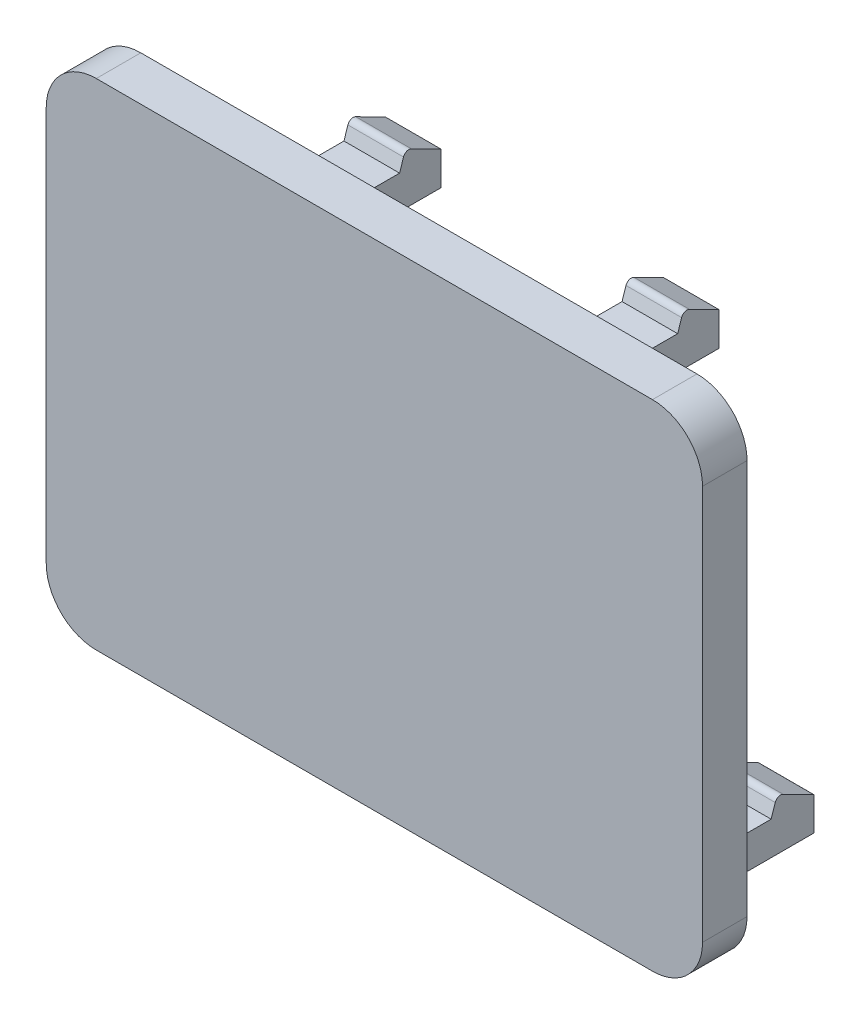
ISO-10303-21;
HEADER;
FILE_DESCRIPTION(('STEP AP214'),'2;1');
FILE_NAME('part.step','',(''),(''),'','','');
FILE_SCHEMA(('AUTOMOTIVE_DESIGN { 1 0 10303 214 1 1 1 1 }'));
ENDSEC;
DATA;
#1=APPLICATION_CONTEXT('core data for automotive mechanical design processes');
#2=APPLICATION_PROTOCOL_DEFINITION('international standard','automotive_design',2000,#1);
#3=PRODUCT_CONTEXT('',#1,'mechanical');
#4=PRODUCT('Part','Part','',(#3));
#5=PRODUCT_RELATED_PRODUCT_CATEGORY('part','',(#4));
#6=PRODUCT_DEFINITION_FORMATION('','',#4);
#7=PRODUCT_DEFINITION_CONTEXT('part definition',#1,'design');
#8=PRODUCT_DEFINITION('design','',#6,#7);
#9=PRODUCT_DEFINITION_SHAPE('','',#8);
#10=(LENGTH_UNIT() NAMED_UNIT(*) SI_UNIT(.MILLI.,.METRE.));
#11=(NAMED_UNIT(*) PLANE_ANGLE_UNIT() SI_UNIT($,.RADIAN.));
#12=(NAMED_UNIT(*) SI_UNIT($,.STERADIAN.) SOLID_ANGLE_UNIT());
#13=UNCERTAINTY_MEASURE_WITH_UNIT(LENGTH_MEASURE(1.E-05),#10,'distance_accuracy_value','');
#14=(GEOMETRIC_REPRESENTATION_CONTEXT(3) GLOBAL_UNCERTAINTY_ASSIGNED_CONTEXT((#13)) GLOBAL_UNIT_ASSIGNED_CONTEXT((#10,
#11,#12)) REPRESENTATION_CONTEXT('',''));
#15=CARTESIAN_POINT('',(0.,0.,0.));
#16=DIRECTION('',(0.,0.,1.));
#17=DIRECTION('',(1.,0.,0.));
#18=AXIS2_PLACEMENT_3D('',#15,#16,#17);
#19=CARTESIAN_POINT('',(9.27689443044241,-17.5,-17.6308331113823));
#20=DIRECTION('',(0.,-1.,0.));
#21=DIRECTION('',(0.,0.,-1.));
#22=AXIS2_PLACEMENT_3D('',#19,#20,#21);
#23=PLANE('',#22);
#24=DIRECTION('',(1.,0.,0.));
#25=VECTOR('',#24,1.);
#26=CARTESIAN_POINT('',(9.27689443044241,-17.4999999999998,-17.625964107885));
#27=LINE('',#26,#25);
#28=CARTESIAN_POINT('',(9.27689443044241,-17.4999999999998,-17.625964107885));
#29=VERTEX_POINT('',#28);
#30=CARTESIAN_POINT('',(14.2768944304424,-17.4999999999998,-17.625964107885));
#31=VERTEX_POINT('',#30);
#32=EDGE_CURVE('E580',#29,#31,#27,.T.);
#33=ORIENTED_EDGE('',*,*,#32,.T.);
#34=DIRECTION('',(0.,0.,1.));
#35=VECTOR('',#34,1.);
#36=CARTESIAN_POINT('',(14.2768944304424,-17.5,-17.6308331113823));
#37=LINE('',#36,#35);
#38=CARTESIAN_POINT('',(14.2768944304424,-17.5,-17.6308331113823));
#39=VERTEX_POINT('',#38);
#40=EDGE_CURVE('E676',#39,#31,#37,.T.);
#41=ORIENTED_EDGE('',*,*,#40,.F.);
#42=DIRECTION('',(1.,0.,0.));
#43=VECTOR('',#42,1.);
#44=CARTESIAN_POINT('',(9.27689443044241,-17.5,-17.6308331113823));
#45=LINE('',#44,#43);
#46=CARTESIAN_POINT('',(9.27689443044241,-17.5,-17.6308331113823));
#47=VERTEX_POINT('',#46);
#48=EDGE_CURVE('E659',#47,#39,#45,.T.);
#49=ORIENTED_EDGE('',*,*,#48,.F.);
#50=DIRECTION('',(0.,0.,1.));
#51=VECTOR('',#50,1.);
#52=CARTESIAN_POINT('',(9.27689443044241,-17.5,-17.6308331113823));
#53=LINE('',#52,#51);
#54=EDGE_CURVE('E680',#47,#29,#53,.T.);
#55=ORIENTED_EDGE('',*,*,#54,.T.);
#56=EDGE_LOOP('',(#33,#41,#49,#55));
#57=FACE_BOUND('',#56,.T.);
#58=ADVANCED_FACE('F35',(#57),#23,.F.);
#59=DIRECTION('',(1.,0.,0.));
#60=VECTOR('',#59,1.);
#61=CARTESIAN_POINT('',(9.27689443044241,-17.4999999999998,-13.798330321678));
#62=LINE('',#61,#60);
#63=CARTESIAN_POINT('',(9.27689443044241,-17.4999999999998,-13.798330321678));
#64=VERTEX_POINT('',#63);
#65=CARTESIAN_POINT('',(14.2768944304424,-17.5,-13.798330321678));
#66=VERTEX_POINT('',#65);
#67=EDGE_CURVE('E577',#64,#66,#62,.T.);
#68=ORIENTED_EDGE('',*,*,#67,.F.);
#69=CARTESIAN_POINT('',(9.27689443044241,-17.5,-3.63083311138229));
#70=VERTEX_POINT('',#69);
#71=EDGE_CURVE('E679',#64,#70,#53,.T.);
#72=ORIENTED_EDGE('',*,*,#71,.T.);
#73=DIRECTION('',(1.,0.,0.));
#74=VECTOR('',#73,1.);
#75=CARTESIAN_POINT('',(9.27689443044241,-17.5,-3.63083311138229));
#76=LINE('',#75,#74);
#77=CARTESIAN_POINT('',(14.2768944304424,-17.5,-3.63083311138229));
#78=VERTEX_POINT('',#77);
#79=EDGE_CURVE('E666',#70,#78,#76,.T.);
#80=ORIENTED_EDGE('',*,*,#79,.T.);
#81=EDGE_CURVE('E675',#66,#78,#37,.T.);
#82=ORIENTED_EDGE('',*,*,#81,.F.);
#83=EDGE_LOOP('',(#68,#72,#80,#82));
#84=FACE_BOUND('',#83,.T.);
#85=ADVANCED_FACE('F965',(#84),#23,.F.);
#86=CARTESIAN_POINT('',(56.2768944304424,-17.5,-17.6308331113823));
#87=DIRECTION('',(0.,-1.,0.));
#88=DIRECTION('',(0.,0.,-1.));
#89=AXIS2_PLACEMENT_3D('',#86,#87,#88);
#90=PLANE('',#89);
#91=DIRECTION('',(0.,0.,1.));
#92=VECTOR('',#91,1.);
#93=CARTESIAN_POINT('',(51.2768944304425,-17.5,-17.6308331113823));
#94=LINE('',#93,#92);
#95=CARTESIAN_POINT('',(51.2768944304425,-17.5,-17.6308331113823));
#96=VERTEX_POINT('',#95);
#97=CARTESIAN_POINT('',(51.2768944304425,-17.5,-17.625964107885));
#98=VERTEX_POINT('',#97);
#99=EDGE_CURVE('E707',#96,#98,#94,.T.);
#100=ORIENTED_EDGE('',*,*,#99,.T.);
#101=DIRECTION('',(1.,0.,0.));
#102=VECTOR('',#101,1.);
#103=CARTESIAN_POINT('',(51.2768944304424,-17.4999999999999,-17.625964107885));
#104=LINE('',#103,#102);
#105=CARTESIAN_POINT('',(56.2768944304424,-17.5,-17.625964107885));
#106=VERTEX_POINT('',#105);
#107=EDGE_CURVE('E602',#98,#106,#104,.T.);
#108=ORIENTED_EDGE('',*,*,#107,.T.);
#109=DIRECTION('',(0.,0.,1.));
#110=VECTOR('',#109,1.);
#111=CARTESIAN_POINT('',(56.2768944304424,-17.5,-17.6308331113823));
#112=LINE('',#111,#110);
#113=CARTESIAN_POINT('',(56.2768944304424,-17.5,-17.6308331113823));
#114=VERTEX_POINT('',#113);
#115=EDGE_CURVE('E715',#114,#106,#112,.T.);
#116=ORIENTED_EDGE('',*,*,#115,.F.);
#117=DIRECTION('',(1.,0.,0.));
#118=VECTOR('',#117,1.);
#119=CARTESIAN_POINT('',(56.2768944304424,-17.5,-17.6308331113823));
#120=LINE('',#119,#118);
#121=EDGE_CURVE('E688',#96,#114,#120,.T.);
#122=ORIENTED_EDGE('',*,*,#121,.F.);
#123=EDGE_LOOP('',(#100,#108,#116,#122));
#124=FACE_BOUND('',#123,.T.);
#125=ADVANCED_FACE('F1009',(#124),#90,.F.);
#126=CARTESIAN_POINT('',(17.7768944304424,16.,-17.6308331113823));
#127=DIRECTION('',(0.,-1.,0.));
#128=DIRECTION('',(0.,0.,-1.));
#129=AXIS2_PLACEMENT_3D('',#126,#127,#128);
#130=PLANE('',#129);
#131=DIRECTION('',(1.,0.,0.));
#132=VECTOR('',#131,1.);
#133=CARTESIAN_POINT('',(17.7768944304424,16.,-13.896730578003));
#134=LINE('',#133,#132);
#135=CARTESIAN_POINT('',(17.7768944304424,16.,-13.896730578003));
#136=VERTEX_POINT('',#135);
#137=CARTESIAN_POINT('',(22.7768944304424,16.,-13.896730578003));
#138=VERTEX_POINT('',#137);
#139=EDGE_CURVE('E628',#136,#138,#134,.T.);
#140=ORIENTED_EDGE('',*,*,#139,.F.);
#141=DIRECTION('',(0.,0.,1.));
#142=VECTOR('',#141,1.);
#143=CARTESIAN_POINT('',(17.7768944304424,16.,-17.6308331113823));
#144=LINE('',#143,#142);
#145=CARTESIAN_POINT('',(17.7768944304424,16.,-3.63083311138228));
#146=VERTEX_POINT('',#145);
#147=EDGE_CURVE('E747',#136,#146,#144,.T.);
#148=ORIENTED_EDGE('',*,*,#147,.T.);
#149=DIRECTION('',(1.,0.,0.));
#150=VECTOR('',#149,1.);
#151=CARTESIAN_POINT('',(17.7768944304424,16.,-3.63083311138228));
#152=LINE('',#151,#150);
#153=CARTESIAN_POINT('',(22.7768944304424,16.,-3.63083311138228));
#154=VERTEX_POINT('',#153);
#155=EDGE_CURVE('E737',#146,#154,#152,.T.);
#156=ORIENTED_EDGE('',*,*,#155,.T.);
#157=DIRECTION('',(0.,0.,1.));
#158=VECTOR('',#157,1.);
#159=CARTESIAN_POINT('',(22.7768944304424,16.,-17.6308331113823));
#160=LINE('',#159,#158);
#161=EDGE_CURVE('E745',#138,#154,#160,.T.);
#162=ORIENTED_EDGE('',*,*,#161,.F.);
#163=EDGE_LOOP('',(#140,#148,#156,#162));
#164=FACE_BOUND('',#163,.T.);
#165=ADVANCED_FACE('F1045',(#164),#130,.F.);
#166=CARTESIAN_POINT('',(66.,25.0000000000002,-3.63083311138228));
#167=DIRECTION('',(0.,0.,1.));
#168=DIRECTION('',(0.,-1.,0.));
#169=AXIS2_PLACEMENT_3D('',#166,#167,#168);
#170=PLANE('',#169);
#171=DIRECTION('',(1.,0.,0.));
#172=VECTOR('',#171,1.);
#173=CARTESIAN_POINT('',(47.7768944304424,16.,-3.63083311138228));
#174=LINE('',#173,#172);
#175=CARTESIAN_POINT('',(42.7768944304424,16.,-3.63083311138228));
#176=VERTEX_POINT('',#175);
#177=CARTESIAN_POINT('',(47.7768944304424,16.,-3.63083311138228));
#178=VERTEX_POINT('',#177);
#179=EDGE_CURVE('E752',#176,#178,#174,.T.);
#180=ORIENTED_EDGE('',*,*,#179,.F.);
#181=DIRECTION('',(0.,1.,0.));
#182=VECTOR('',#181,1.);
#183=CARTESIAN_POINT('',(42.7768944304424,16.,-3.63083311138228));
#184=LINE('',#183,#182);
#185=CARTESIAN_POINT('',(42.7768944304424,13.,-3.63083311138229));
#186=VERTEX_POINT('',#185);
#187=EDGE_CURVE('E757',#186,#176,#184,.T.);
#188=ORIENTED_EDGE('',*,*,#187,.F.);
#189=DIRECTION('',(-1.,0.,0.));
#190=VECTOR('',#189,1.);
#191=CARTESIAN_POINT('',(42.7768944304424,13.,-3.63083311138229));
#192=LINE('',#191,#190);
#193=CARTESIAN_POINT('',(47.7768944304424,13.,-3.63083311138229));
#194=VERTEX_POINT('',#193);
#195=EDGE_CURVE('E772',#194,#186,#192,.T.);
#196=ORIENTED_EDGE('',*,*,#195,.F.);
#197=DIRECTION('',(0.,-1.,0.));
#198=VECTOR('',#197,1.);
#199=CARTESIAN_POINT('',(47.7768944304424,16.,-3.63083311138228));
#200=LINE('',#199,#198);
#201=EDGE_CURVE('E769',#178,#194,#200,.T.);
#202=ORIENTED_EDGE('',*,*,#201,.F.);
#203=EDGE_LOOP('',(#180,#188,#196,#202));
#204=FACE_BOUND('',#203,.T.);
#205=DIRECTION('',(-1.,0.,0.));
#206=VECTOR('',#205,1.);
#207=CARTESIAN_POINT('',(22.7768944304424,13.,-3.63083311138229));
#208=LINE('',#207,#206);
#209=CARTESIAN_POINT('',(22.7768944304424,13.,-3.63083311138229));
#210=VERTEX_POINT('',#209);
#211=CARTESIAN_POINT('',(17.7768944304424,13.,-3.63083311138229));
#212=VERTEX_POINT('',#211);
#213=EDGE_CURVE('E718',#210,#212,#208,.T.);
#214=ORIENTED_EDGE('',*,*,#213,.F.);
#215=DIRECTION('',(0.,-1.,0.));
#216=VECTOR('',#215,1.);
#217=CARTESIAN_POINT('',(22.7768944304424,16.,-3.63083311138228));
#218=LINE('',#217,#216);
#219=EDGE_CURVE('E740',#154,#210,#218,.T.);
#220=ORIENTED_EDGE('',*,*,#219,.F.);
#221=ORIENTED_EDGE('',*,*,#155,.F.);
#222=DIRECTION('',(0.,1.,0.));
#223=VECTOR('',#222,1.);
#224=CARTESIAN_POINT('',(17.7768944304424,16.,-3.63083311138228));
#225=LINE('',#224,#223);
#226=EDGE_CURVE('E734',#212,#146,#225,.T.);
#227=ORIENTED_EDGE('',*,*,#226,.F.);
#228=EDGE_LOOP('',(#214,#220,#221,#227));
#229=FACE_BOUND('',#228,.T.);
#230=DIRECTION('',(0.,1.,0.));
#231=VECTOR('',#230,1.);
#232=CARTESIAN_POINT('',(9.27689443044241,-17.5,-3.63083311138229));
#233=LINE('',#232,#231);
#234=CARTESIAN_POINT('',(9.27689443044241,-20.5,-3.63083311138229));
#235=VERTEX_POINT('',#234);
#236=EDGE_CURVE('E652',#235,#70,#233,.T.);
#237=ORIENTED_EDGE('',*,*,#236,.F.);
#238=DIRECTION('',(-1.,0.,0.));
#239=VECTOR('',#238,1.);
#240=CARTESIAN_POINT('',(5.27689443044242,-20.5,-3.63083311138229));
#241=LINE('',#240,#239);
#242=CARTESIAN_POINT('',(5.27689443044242,-20.5,-3.63083311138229));
#243=VERTEX_POINT('',#242);
#244=EDGE_CURVE('E820',#235,#243,#241,.T.);
#245=ORIENTED_EDGE('',*,*,#244,.T.);
#246=CARTESIAN_POINT('',(5.27689443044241,-19.5,-3.63083311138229));
#247=DIRECTION('',(0.,0.,-1.));
#248=DIRECTION('',(0.,1.,0.));
#249=AXIS2_PLACEMENT_3D('',#246,#247,#248);
#250=CIRCLE('',#249,1.);
#251=CARTESIAN_POINT('',(4.27689443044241,-19.5,-3.63083311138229));
#252=VERTEX_POINT('',#251);
#253=EDGE_CURVE('E824',#243,#252,#250,.T.);
#254=ORIENTED_EDGE('',*,*,#253,.T.);
#255=DIRECTION('',(0.,1.,0.));
#256=VECTOR('',#255,1.);
#257=CARTESIAN_POINT('',(4.27689443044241,-19.5,-3.63083311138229));
#258=LINE('',#257,#256);
#259=CARTESIAN_POINT('',(4.27689443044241,19.,-3.63083311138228));
#260=VERTEX_POINT('',#259);
#261=EDGE_CURVE('E828',#252,#260,#258,.T.);
#262=ORIENTED_EDGE('',*,*,#261,.T.);
#263=CARTESIAN_POINT('',(5.27689443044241,19.,-3.63083311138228));
#264=DIRECTION('',(0.,0.,-1.));
#265=DIRECTION('',(0.,-1.,0.));
#266=AXIS2_PLACEMENT_3D('',#263,#264,#265);
#267=CIRCLE('',#266,1.);
#268=CARTESIAN_POINT('',(5.27689443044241,20.,-3.63083311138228));
#269=VERTEX_POINT('',#268);
#270=EDGE_CURVE('E790',#260,#269,#267,.T.);
#271=ORIENTED_EDGE('',*,*,#270,.T.);
#272=DIRECTION('',(1.,0.,0.));
#273=VECTOR('',#272,1.);
#274=CARTESIAN_POINT('',(60.2768944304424,20.,-3.63083311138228));
#275=LINE('',#274,#273);
#276=CARTESIAN_POINT('',(60.2768944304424,20.,-3.63083311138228));
#277=VERTEX_POINT('',#276);
#278=EDGE_CURVE('E786',#269,#277,#275,.T.);
#279=ORIENTED_EDGE('',*,*,#278,.T.);
#280=CARTESIAN_POINT('',(60.2768944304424,19.,-3.63083311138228));
#281=DIRECTION('',(0.,0.,-1.));
#282=DIRECTION('',(0.,-1.,0.));
#283=AXIS2_PLACEMENT_3D('',#280,#281,#282);
#284=CIRCLE('',#283,1.);
#285=CARTESIAN_POINT('',(61.2768944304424,19.,-3.63083311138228));
#286=VERTEX_POINT('',#285);
#287=EDGE_CURVE('E811',#277,#286,#284,.T.);
#288=ORIENTED_EDGE('',*,*,#287,.T.);
#289=DIRECTION('',(0.,-1.,0.));
#290=VECTOR('',#289,1.);
#291=CARTESIAN_POINT('',(61.2768944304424,19.,-3.63083311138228));
#292=LINE('',#291,#290);
#293=CARTESIAN_POINT('',(61.2768944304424,-19.5,-3.63083311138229));
#294=VERTEX_POINT('',#293);
#295=EDGE_CURVE('E814',#286,#294,#292,.T.);
#296=ORIENTED_EDGE('',*,*,#295,.T.);
#297=CARTESIAN_POINT('',(60.2768944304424,-19.5,-3.63083311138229));
#298=DIRECTION('',(0.,0.,-1.));
#299=DIRECTION('',(0.,1.,0.));
#300=AXIS2_PLACEMENT_3D('',#297,#298,#299);
#301=CIRCLE('',#300,1.);
#302=CARTESIAN_POINT('',(60.2768944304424,-20.5,-3.63083311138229));
#303=VERTEX_POINT('',#302);
#304=EDGE_CURVE('E817',#294,#303,#301,.T.);
#305=ORIENTED_EDGE('',*,*,#304,.T.);
#306=CARTESIAN_POINT('',(56.2768944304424,-20.5,-3.63083311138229));
#307=VERTEX_POINT('',#306);
#308=EDGE_CURVE('E821',#303,#307,#241,.T.);
#309=ORIENTED_EDGE('',*,*,#308,.T.);
#310=DIRECTION('',(0.,-1.,0.));
#311=VECTOR('',#310,1.);
#312=CARTESIAN_POINT('',(56.2768944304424,-17.5,-3.63083311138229));
#313=LINE('',#312,#311);
#314=CARTESIAN_POINT('',(56.2768944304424,-17.5,-3.63083311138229));
#315=VERTEX_POINT('',#314);
#316=EDGE_CURVE('E703',#315,#307,#313,.T.);
#317=ORIENTED_EDGE('',*,*,#316,.F.);
#318=DIRECTION('',(1.,0.,0.));
#319=VECTOR('',#318,1.);
#320=CARTESIAN_POINT('',(56.2768944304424,-17.5,-3.63083311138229));
#321=LINE('',#320,#319);
#322=CARTESIAN_POINT('',(51.2768944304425,-17.5,-3.63083311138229));
#323=VERTEX_POINT('',#322);
#324=EDGE_CURVE('E687',#323,#315,#321,.T.);
#325=ORIENTED_EDGE('',*,*,#324,.F.);
#326=DIRECTION('',(0.,1.,0.));
#327=VECTOR('',#326,1.);
#328=CARTESIAN_POINT('',(51.2768944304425,-17.5,-3.63083311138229));
#329=LINE('',#328,#327);
#330=CARTESIAN_POINT('',(51.2768944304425,-20.5,-3.63083311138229));
#331=VERTEX_POINT('',#330);
#332=EDGE_CURVE('E692',#331,#323,#329,.T.);
#333=ORIENTED_EDGE('',*,*,#332,.F.);
#334=CARTESIAN_POINT('',(14.2768944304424,-20.5,-3.63083311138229));
#335=VERTEX_POINT('',#334);
#336=EDGE_CURVE('E825',#331,#335,#241,.T.);
#337=ORIENTED_EDGE('',*,*,#336,.T.);
#338=DIRECTION('',(0.,-1.,0.));
#339=VECTOR('',#338,1.);
#340=CARTESIAN_POINT('',(14.2768944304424,-17.5,-3.63083311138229));
#341=LINE('',#340,#339);
#342=EDGE_CURVE('E669',#78,#335,#341,.T.);
#343=ORIENTED_EDGE('',*,*,#342,.F.);
#344=ORIENTED_EDGE('',*,*,#79,.F.);
#345=EDGE_LOOP('',(#237,#245,#254,#262,#271,#279,#288,#296,#305,#309,#317,#325,#333,#337,#343,#344));
#346=FACE_BOUND('',#345,.T.);
#347=ADVANCED_FACE('F954',(#204,#229,#346),#170,.F.);
#348=CARTESIAN_POINT('',(5.27689443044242,-20.5,-5.63083311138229));
#349=DIRECTION('',(0.,1.,0.));
#350=DIRECTION('',(0.,0.,1.));
#351=AXIS2_PLACEMENT_3D('',#348,#349,#350);
#352=PLANE('',#351);
#353=ORIENTED_EDGE('',*,*,#244,.F.);
#354=DIRECTION('',(0.,0.,1.));
#355=VECTOR('',#354,1.);
#356=CARTESIAN_POINT('',(9.27689443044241,-20.5,-17.6308331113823));
#357=LINE('',#356,#355);
#358=CARTESIAN_POINT('',(9.27689443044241,-20.5,-5.63083311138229));
#359=VERTEX_POINT('',#358);
#360=EDGE_CURVE('E683',#359,#235,#357,.T.);
#361=ORIENTED_EDGE('',*,*,#360,.F.);
#362=DIRECTION('',(-1.,0.,0.));
#363=VECTOR('',#362,1.);
#364=CARTESIAN_POINT('',(60.2768944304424,-20.5,-5.63083311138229));
#365=LINE('',#364,#363);
#366=CARTESIAN_POINT('',(5.27689443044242,-20.5,-5.63083311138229));
#367=VERTEX_POINT('',#366);
#368=EDGE_CURVE('E796',#359,#367,#365,.T.);
#369=ORIENTED_EDGE('',*,*,#368,.T.);
#370=DIRECTION('',(0.,0.,1.));
#371=VECTOR('',#370,1.);
#372=CARTESIAN_POINT('',(5.27689443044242,-20.5,-5.63083311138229));
#373=LINE('',#372,#371);
#374=EDGE_CURVE('E839',#367,#243,#373,.T.);
#375=ORIENTED_EDGE('',*,*,#374,.T.);
#376=EDGE_LOOP('',(#353,#361,#369,#375));
#377=FACE_BOUND('',#376,.T.);
#378=ADVANCED_FACE('F939',(#377),#352,.T.);
#379=CARTESIAN_POINT('',(51.2768944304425,-20.5,-5.63083311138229));
#380=VERTEX_POINT('',#379);
#381=CARTESIAN_POINT('',(14.2768944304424,-20.5,-5.63083311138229));
#382=VERTEX_POINT('',#381);
#383=EDGE_CURVE('E920',#380,#382,#365,.T.);
#384=ORIENTED_EDGE('',*,*,#383,.T.);
#385=DIRECTION('',(0.,0.,1.));
#386=VECTOR('',#385,1.);
#387=CARTESIAN_POINT('',(14.2768944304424,-20.5,-17.6308331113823));
#388=LINE('',#387,#386);
#389=EDGE_CURVE('E663',#382,#335,#388,.T.);
#390=ORIENTED_EDGE('',*,*,#389,.T.);
#391=ORIENTED_EDGE('',*,*,#336,.F.);
#392=DIRECTION('',(0.,0.,-1.));
#393=VECTOR('',#392,1.);
#394=CARTESIAN_POINT('',(51.2768944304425,-20.5,-5.63083311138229));
#395=LINE('',#394,#393);
#396=EDGE_CURVE('E43',#331,#380,#395,.T.);
#397=ORIENTED_EDGE('',*,*,#396,.T.);
#398=EDGE_LOOP('',(#384,#390,#391,#397));
#399=FACE_BOUND('',#398,.T.);
#400=ADVANCED_FACE('F919',(#399),#352,.T.);
#401=CARTESIAN_POINT('',(60.2768944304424,-20.5,-5.63083311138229));
#402=VERTEX_POINT('',#401);
#403=CARTESIAN_POINT('',(56.2768944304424,-20.5,-5.63083311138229));
#404=VERTEX_POINT('',#403);
#405=EDGE_CURVE('E797',#402,#404,#365,.T.);
#406=ORIENTED_EDGE('',*,*,#405,.T.);
#407=DIRECTION('',(0.,0.,1.));
#408=VECTOR('',#407,1.);
#409=CARTESIAN_POINT('',(56.2768944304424,-20.5,-5.63083311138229));
#410=LINE('',#409,#408);
#411=EDGE_CURVE('E11',#404,#307,#410,.T.);
#412=ORIENTED_EDGE('',*,*,#411,.T.);
#413=ORIENTED_EDGE('',*,*,#308,.F.);
#414=DIRECTION('',(0.,0.,1.));
#415=VECTOR('',#414,1.);
#416=CARTESIAN_POINT('',(60.2768944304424,-20.5,-5.63083311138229));
#417=LINE('',#416,#415);
#418=EDGE_CURVE('E842',#402,#303,#417,.T.);
#419=ORIENTED_EDGE('',*,*,#418,.F.);
#420=EDGE_LOOP('',(#406,#412,#413,#419));
#421=FACE_BOUND('',#420,.T.);
#422=ADVANCED_FACE('F1085',(#421),#352,.T.);
#423=CARTESIAN_POINT('',(7.77689443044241,17.5,-3.63083311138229));
#424=DIRECTION('',(0.,0.,1.));
#425=DIRECTION('',(1.,0.,0.));
#426=AXIS2_PLACEMENT_3D('',#423,#424,#425);
#427=CYLINDRICAL_SURFACE('',#426,4.5);
#428=CARTESIAN_POINT('',(7.77689443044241,17.5,-1.63083311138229));
#429=DIRECTION('',(0.,0.,-1.));
#430=DIRECTION('',(-1.,0.,0.));
#431=AXIS2_PLACEMENT_3D('',#428,#429,#430);
#432=CIRCLE('',#431,4.5);
#433=CARTESIAN_POINT('',(3.27689443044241,17.5,-1.63083311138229));
#434=VERTEX_POINT('',#433);
#435=CARTESIAN_POINT('',(7.77689443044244,22.,-1.63083311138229));
#436=VERTEX_POINT('',#435);
#437=EDGE_CURVE('E913',#434,#436,#432,.T.);
#438=ORIENTED_EDGE('',*,*,#437,.T.);
#439=DIRECTION('',(0.,0.,1.));
#440=VECTOR('',#439,1.);
#441=CARTESIAN_POINT('',(7.77689443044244,22.,-3.63083311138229));
#442=LINE('',#441,#440);
#443=CARTESIAN_POINT('',(7.77689443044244,22.,-5.63083311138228));
#444=VERTEX_POINT('',#443);
#445=EDGE_CURVE('E876',#444,#436,#442,.T.);
#446=ORIENTED_EDGE('',*,*,#445,.F.);
#447=CARTESIAN_POINT('',(7.77689443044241,17.5,-5.63083311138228));
#448=DIRECTION('',(0.,0.,-1.));
#449=DIRECTION('',(0.,1.,0.));
#450=AXIS2_PLACEMENT_3D('',#447,#448,#449);
#451=CIRCLE('',#450,4.5);
#452=CARTESIAN_POINT('',(3.27689443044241,17.5,-5.63083311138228));
#453=VERTEX_POINT('',#452);
#454=EDGE_CURVE('E851',#453,#444,#451,.T.);
#455=ORIENTED_EDGE('',*,*,#454,.F.);
#456=DIRECTION('',(0.,0.,1.));
#457=VECTOR('',#456,1.);
#458=CARTESIAN_POINT('',(3.27689443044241,17.5,-3.63083311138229));
#459=LINE('',#458,#457);
#460=EDGE_CURVE('E875',#453,#434,#459,.T.);
#461=ORIENTED_EDGE('',*,*,#460,.T.);
#462=EDGE_LOOP('',(#438,#446,#455,#461));
#463=FACE_BOUND('',#462,.T.);
#464=ADVANCED_FACE('F1088',(#463),#427,.T.);
#465=CARTESIAN_POINT('',(7.77689443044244,22.,-3.63083311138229));
#466=DIRECTION('',(0.,1.,0.));
#467=DIRECTION('',(-1.,0.,0.));
#468=AXIS2_PLACEMENT_3D('',#465,#466,#467);
#469=PLANE('',#468);
#470=DIRECTION('',(1.,0.,0.));
#471=VECTOR('',#470,1.);
#472=CARTESIAN_POINT('',(66.,22.,-1.63083311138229));
#473=LINE('',#472,#471);
#474=CARTESIAN_POINT('',(57.7768944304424,22.,-1.63083311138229));
#475=VERTEX_POINT('',#474);
#476=EDGE_CURVE('E911',#436,#475,#473,.T.);
#477=ORIENTED_EDGE('',*,*,#476,.T.);
#478=DIRECTION('',(0.,0.,1.));
#479=VECTOR('',#478,1.);
#480=CARTESIAN_POINT('',(57.7768944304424,22.,-3.63083311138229));
#481=LINE('',#480,#479);
#482=CARTESIAN_POINT('',(57.7768944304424,22.,-5.63083311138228));
#483=VERTEX_POINT('',#482);
#484=EDGE_CURVE('E880',#483,#475,#481,.T.);
#485=ORIENTED_EDGE('',*,*,#484,.F.);
#486=DIRECTION('',(1.,0.,0.));
#487=VECTOR('',#486,1.);
#488=CARTESIAN_POINT('',(7.77689443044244,22.,-5.63083311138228));
#489=LINE('',#488,#487);
#490=EDGE_CURVE('E854',#444,#483,#489,.T.);
#491=ORIENTED_EDGE('',*,*,#490,.F.);
#492=ORIENTED_EDGE('',*,*,#445,.T.);
#493=EDGE_LOOP('',(#477,#485,#491,#492));
#494=FACE_BOUND('',#493,.T.);
#495=ADVANCED_FACE('F1108',(#494),#469,.T.);
#496=CARTESIAN_POINT('',(57.7768944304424,17.5,-3.63083311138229));
#497=DIRECTION('',(0.,0.,1.));
#498=DIRECTION('',(1.,0.,0.));
#499=AXIS2_PLACEMENT_3D('',#496,#497,#498);
#500=CYLINDRICAL_SURFACE('',#499,4.5);
#501=CARTESIAN_POINT('',(57.7768944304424,17.5,-1.63083311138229));
#502=DIRECTION('',(0.,0.,-1.));
#503=DIRECTION('',(-1.,0.,0.));
#504=AXIS2_PLACEMENT_3D('',#501,#502,#503);
#505=CIRCLE('',#504,4.5);
#506=CARTESIAN_POINT('',(62.2768944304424,17.5,-1.63083311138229));
#507=VERTEX_POINT('',#506);
#508=EDGE_CURVE('E909',#475,#507,#505,.T.);
#509=ORIENTED_EDGE('',*,*,#508,.T.);
#510=DIRECTION('',(0.,0.,1.));
#511=VECTOR('',#510,1.);
#512=CARTESIAN_POINT('',(62.2768944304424,17.5,-3.63083311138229));
#513=LINE('',#512,#511);
#514=CARTESIAN_POINT('',(62.2768944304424,17.5,-5.63083311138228));
#515=VERTEX_POINT('',#514);
#516=EDGE_CURVE('E883',#515,#507,#513,.T.);
#517=ORIENTED_EDGE('',*,*,#516,.F.);
#518=CARTESIAN_POINT('',(57.7768944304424,17.5,-5.63083311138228));
#519=DIRECTION('',(0.,0.,-1.));
#520=DIRECTION('',(0.,1.,0.));
#521=AXIS2_PLACEMENT_3D('',#518,#519,#520);
#522=CIRCLE('',#521,4.5);
#523=EDGE_CURVE('E857',#483,#515,#522,.T.);
#524=ORIENTED_EDGE('',*,*,#523,.F.);
#525=ORIENTED_EDGE('',*,*,#484,.T.);
#526=EDGE_LOOP('',(#509,#517,#524,#525));
#527=FACE_BOUND('',#526,.T.);
#528=ADVANCED_FACE('F1111',(#527),#500,.T.);
#529=CARTESIAN_POINT('',(62.2768944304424,17.5,-3.63083311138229));
#530=DIRECTION('',(1.,0.,0.));
#531=DIRECTION('',(0.,0.,-1.));
#532=AXIS2_PLACEMENT_3D('',#529,#530,#531);
#533=PLANE('',#532);
#534=DIRECTION('',(0.,-1.,0.));
#535=VECTOR('',#534,1.);
#536=CARTESIAN_POINT('',(62.2768944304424,25.,-1.63083311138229));
#537=LINE('',#536,#535);
#538=CARTESIAN_POINT('',(62.2768944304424,-18.,-1.63083311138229));
#539=VERTEX_POINT('',#538);
#540=EDGE_CURVE('E907',#507,#539,#537,.T.);
#541=ORIENTED_EDGE('',*,*,#540,.T.);
#542=DIRECTION('',(0.,0.,1.));
#543=VECTOR('',#542,1.);
#544=CARTESIAN_POINT('',(62.2768944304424,-18.,-3.63083311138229));
#545=LINE('',#544,#543);
#546=CARTESIAN_POINT('',(62.2768944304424,-18.,-5.63083311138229));
#547=VERTEX_POINT('',#546);
#548=EDGE_CURVE('E886',#547,#539,#545,.T.);
#549=ORIENTED_EDGE('',*,*,#548,.F.);
#550=DIRECTION('',(0.,-1.,0.));
#551=VECTOR('',#550,1.);
#552=CARTESIAN_POINT('',(62.2768944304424,17.5,-5.63083311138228));
#553=LINE('',#552,#551);
#554=EDGE_CURVE('E860',#515,#547,#553,.T.);
#555=ORIENTED_EDGE('',*,*,#554,.F.);
#556=ORIENTED_EDGE('',*,*,#516,.T.);
#557=EDGE_LOOP('',(#541,#549,#555,#556));
#558=FACE_BOUND('',#557,.T.);
#559=ADVANCED_FACE('F1115',(#558),#533,.T.);
#560=CARTESIAN_POINT('',(57.7768944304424,-18.,-3.63083311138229));
#561=DIRECTION('',(0.,0.,1.));
#562=DIRECTION('',(1.,0.,0.));
#563=AXIS2_PLACEMENT_3D('',#560,#561,#562);
#564=CYLINDRICAL_SURFACE('',#563,4.5);
#565=CARTESIAN_POINT('',(57.7768944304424,-18.,-1.63083311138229));
#566=DIRECTION('',(0.,0.,-1.));
#567=DIRECTION('',(-1.,0.,0.));
#568=AXIS2_PLACEMENT_3D('',#565,#566,#567);
#569=CIRCLE('',#568,4.5);
#570=CARTESIAN_POINT('',(57.7768944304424,-22.5,-1.63083311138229));
#571=VERTEX_POINT('',#570);
#572=EDGE_CURVE('E905',#539,#571,#569,.T.);
#573=ORIENTED_EDGE('',*,*,#572,.T.);
#574=DIRECTION('',(0.,0.,1.));
#575=VECTOR('',#574,1.);
#576=CARTESIAN_POINT('',(57.7768944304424,-22.5,-3.63083311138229));
#577=LINE('',#576,#575);
#578=CARTESIAN_POINT('',(57.7768944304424,-22.5,-5.63083311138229));
#579=VERTEX_POINT('',#578);
#580=EDGE_CURVE('E889',#579,#571,#577,.T.);
#581=ORIENTED_EDGE('',*,*,#580,.F.);
#582=CARTESIAN_POINT('',(57.7768944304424,-18.,-5.63083311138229));
#583=DIRECTION('',(0.,0.,-1.));
#584=DIRECTION('',(0.,1.,0.));
#585=AXIS2_PLACEMENT_3D('',#582,#583,#584);
#586=CIRCLE('',#585,4.5);
#587=EDGE_CURVE('E863',#547,#579,#586,.T.);
#588=ORIENTED_EDGE('',*,*,#587,.F.);
#589=ORIENTED_EDGE('',*,*,#548,.T.);
#590=EDGE_LOOP('',(#573,#581,#588,#589));
#591=FACE_BOUND('',#590,.T.);
#592=ADVANCED_FACE('F1119',(#591),#564,.T.);
#593=CARTESIAN_POINT('',(57.7768944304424,-22.5,-3.63083311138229));
#594=DIRECTION('',(0.,-1.,0.));
#595=DIRECTION('',(0.,0.,-1.));
#596=AXIS2_PLACEMENT_3D('',#593,#594,#595);
#597=PLANE('',#596);
#598=DIRECTION('',(-1.,0.,0.));
#599=VECTOR('',#598,1.);
#600=CARTESIAN_POINT('',(66.,-22.5,-1.63083311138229));
#601=LINE('',#600,#599);
#602=CARTESIAN_POINT('',(7.77689443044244,-22.5,-1.63083311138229));
#603=VERTEX_POINT('',#602);
#604=EDGE_CURVE('E903',#571,#603,#601,.T.);
#605=ORIENTED_EDGE('',*,*,#604,.T.);
#606=DIRECTION('',(0.,0.,1.));
#607=VECTOR('',#606,1.);
#608=CARTESIAN_POINT('',(7.77689443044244,-22.5,-3.63083311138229));
#609=LINE('',#608,#607);
#610=CARTESIAN_POINT('',(7.77689443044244,-22.5,-5.63083311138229));
#611=VERTEX_POINT('',#610);
#612=EDGE_CURVE('E892',#611,#603,#609,.T.);
#613=ORIENTED_EDGE('',*,*,#612,.F.);
#614=DIRECTION('',(-1.,0.,0.));
#615=VECTOR('',#614,1.);
#616=CARTESIAN_POINT('',(57.7768944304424,-22.5,-5.63083311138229));
#617=LINE('',#616,#615);
#618=EDGE_CURVE('E866',#579,#611,#617,.T.);
#619=ORIENTED_EDGE('',*,*,#618,.F.);
#620=ORIENTED_EDGE('',*,*,#580,.T.);
#621=EDGE_LOOP('',(#605,#613,#619,#620));
#622=FACE_BOUND('',#621,.T.);
#623=ADVANCED_FACE('F1123',(#622),#597,.T.);
#624=CARTESIAN_POINT('',(7.77689443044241,-18.,-3.63083311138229));
#625=DIRECTION('',(0.,0.,1.));
#626=DIRECTION('',(1.,0.,0.));
#627=AXIS2_PLACEMENT_3D('',#624,#625,#626);
#628=CYLINDRICAL_SURFACE('',#627,4.5);
#629=CARTESIAN_POINT('',(7.77689443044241,-18.,-1.63083311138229));
#630=DIRECTION('',(0.,0.,-1.));
#631=DIRECTION('',(-1.,0.,0.));
#632=AXIS2_PLACEMENT_3D('',#629,#630,#631);
#633=CIRCLE('',#632,4.5);
#634=CARTESIAN_POINT('',(3.27689443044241,-18.,-1.63083311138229));
#635=VERTEX_POINT('',#634);
#636=EDGE_CURVE('E900',#603,#635,#633,.T.);
#637=ORIENTED_EDGE('',*,*,#636,.T.);
#638=DIRECTION('',(0.,0.,1.));
#639=VECTOR('',#638,1.);
#640=CARTESIAN_POINT('',(3.27689443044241,-18.,-3.63083311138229));
#641=LINE('',#640,#639);
#642=CARTESIAN_POINT('',(3.27689443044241,-18.,-5.63083311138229));
#643=VERTEX_POINT('',#642);
#644=EDGE_CURVE('E895',#643,#635,#641,.T.);
#645=ORIENTED_EDGE('',*,*,#644,.F.);
#646=CARTESIAN_POINT('',(7.77689443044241,-18.,-5.63083311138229));
#647=DIRECTION('',(0.,0.,-1.));
#648=DIRECTION('',(0.,1.,0.));
#649=AXIS2_PLACEMENT_3D('',#646,#647,#648);
#650=CIRCLE('',#649,4.5);
#651=EDGE_CURVE('E869',#611,#643,#650,.T.);
#652=ORIENTED_EDGE('',*,*,#651,.F.);
#653=ORIENTED_EDGE('',*,*,#612,.T.);
#654=EDGE_LOOP('',(#637,#645,#652,#653));
#655=FACE_BOUND('',#654,.T.);
#656=ADVANCED_FACE('F1127',(#655),#628,.T.);
#657=CARTESIAN_POINT('',(3.27689443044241,-18.,-3.63083311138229));
#658=DIRECTION('',(-1.,0.,0.));
#659=DIRECTION('',(0.,0.,1.));
#660=AXIS2_PLACEMENT_3D('',#657,#658,#659);
#661=PLANE('',#660);
#662=DIRECTION('',(0.,1.,0.));
#663=VECTOR('',#662,1.);
#664=CARTESIAN_POINT('',(3.27689443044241,25.,-1.63083311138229));
#665=LINE('',#664,#663);
#666=EDGE_CURVE('E879',#635,#434,#665,.T.);
#667=ORIENTED_EDGE('',*,*,#666,.T.);
#668=ORIENTED_EDGE('',*,*,#460,.F.);
#669=DIRECTION('',(0.,1.,0.));
#670=VECTOR('',#669,1.);
#671=CARTESIAN_POINT('',(3.27689443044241,-18.,-5.63083311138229));
#672=LINE('',#671,#670);
#673=EDGE_CURVE('E872',#643,#453,#672,.T.);
#674=ORIENTED_EDGE('',*,*,#673,.F.);
#675=ORIENTED_EDGE('',*,*,#644,.T.);
#676=EDGE_LOOP('',(#667,#668,#674,#675));
#677=FACE_BOUND('',#676,.T.);
#678=ADVANCED_FACE('F1131',(#677),#661,.T.);
#679=CARTESIAN_POINT('',(66.,25.,-1.63083311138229));
#680=DIRECTION('',(0.,0.,-1.));
#681=DIRECTION('',(-1.,0.,0.));
#682=AXIS2_PLACEMENT_3D('',#679,#680,#681);
#683=PLANE('',#682);
#684=ORIENTED_EDGE('',*,*,#437,.F.);
#685=ORIENTED_EDGE('',*,*,#666,.F.);
#686=ORIENTED_EDGE('',*,*,#636,.F.);
#687=ORIENTED_EDGE('',*,*,#604,.F.);
#688=ORIENTED_EDGE('',*,*,#572,.F.);
#689=ORIENTED_EDGE('',*,*,#540,.F.);
#690=ORIENTED_EDGE('',*,*,#508,.F.);
#691=ORIENTED_EDGE('',*,*,#476,.F.);
#692=EDGE_LOOP('',(#684,#685,#686,#687,#688,#689,#690,#691));
#693=FACE_BOUND('',#692,.T.);
#694=ADVANCED_FACE('F37',(#693),#683,.F.);
#695=CARTESIAN_POINT('',(7.77689443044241,17.5,-5.63083311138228));
#696=DIRECTION('',(0.,0.,-1.));
#697=DIRECTION('',(0.,1.,0.));
#698=AXIS2_PLACEMENT_3D('',#695,#696,#697);
#699=PLANE('',#698);
#700=ORIENTED_EDGE('',*,*,#454,.T.);
#701=ORIENTED_EDGE('',*,*,#490,.T.);
#702=ORIENTED_EDGE('',*,*,#523,.T.);
#703=ORIENTED_EDGE('',*,*,#554,.T.);
#704=ORIENTED_EDGE('',*,*,#587,.T.);
#705=ORIENTED_EDGE('',*,*,#618,.T.);
#706=ORIENTED_EDGE('',*,*,#651,.T.);
#707=ORIENTED_EDGE('',*,*,#673,.T.);
#708=EDGE_LOOP('',(#700,#701,#702,#703,#704,#705,#706,#707));
#709=FACE_BOUND('',#708,.T.);
#710=CARTESIAN_POINT('',(60.2768944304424,19.,-5.63083311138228));
#711=DIRECTION('',(0.,0.,-1.));
#712=DIRECTION('',(0.,-1.,0.));
#713=AXIS2_PLACEMENT_3D('',#710,#711,#712);
#714=CIRCLE('',#713,1.);
#715=CARTESIAN_POINT('',(60.2768944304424,20.,-5.63083311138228));
#716=VERTEX_POINT('',#715);
#717=CARTESIAN_POINT('',(61.2768944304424,19.,-5.63083311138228));
#718=VERTEX_POINT('',#717);
#719=EDGE_CURVE('E789',#716,#718,#714,.T.);
#720=ORIENTED_EDGE('',*,*,#719,.F.);
#721=DIRECTION('',(1.,0.,0.));
#722=VECTOR('',#721,1.);
#723=CARTESIAN_POINT('',(5.77689443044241,20.,-5.63083311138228));
#724=LINE('',#723,#722);
#725=CARTESIAN_POINT('',(5.27689443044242,20.,-5.63083311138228));
#726=VERTEX_POINT('',#725);
#727=EDGE_CURVE('E787',#726,#716,#724,.T.);
#728=ORIENTED_EDGE('',*,*,#727,.F.);
#729=CARTESIAN_POINT('',(5.27689443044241,19.,-5.63083311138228));
#730=DIRECTION('',(0.,0.,-1.));
#731=DIRECTION('',(0.,-1.,0.));
#732=AXIS2_PLACEMENT_3D('',#729,#730,#731);
#733=CIRCLE('',#732,1.);
#734=CARTESIAN_POINT('',(4.27689443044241,19.,-5.63083311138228));
#735=VERTEX_POINT('',#734);
#736=EDGE_CURVE('E806',#735,#726,#733,.T.);
#737=ORIENTED_EDGE('',*,*,#736,.F.);
#738=DIRECTION('',(0.,1.,0.));
#739=VECTOR('',#738,1.);
#740=CARTESIAN_POINT('',(4.27689443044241,-19.5,-5.63083311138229));
#741=LINE('',#740,#739);
#742=CARTESIAN_POINT('',(4.27689443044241,-19.5,-5.63083311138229));
#743=VERTEX_POINT('',#742);
#744=EDGE_CURVE('E803',#743,#735,#741,.T.);
#745=ORIENTED_EDGE('',*,*,#744,.F.);
#746=CARTESIAN_POINT('',(5.27689443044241,-19.5,-5.63083311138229));
#747=DIRECTION('',(0.,0.,-1.));
#748=DIRECTION('',(0.,1.,0.));
#749=AXIS2_PLACEMENT_3D('',#746,#747,#748);
#750=CIRCLE('',#749,1.);
#751=EDGE_CURVE('E800',#367,#743,#750,.T.);
#752=ORIENTED_EDGE('',*,*,#751,.F.);
#753=ORIENTED_EDGE('',*,*,#368,.F.);
#754=EDGE_CURVE('E932',#382,#359,#365,.T.);
#755=ORIENTED_EDGE('',*,*,#754,.F.);
#756=ORIENTED_EDGE('',*,*,#383,.F.);
#757=EDGE_CURVE('E801',#404,#380,#365,.T.);
#758=ORIENTED_EDGE('',*,*,#757,.F.);
#759=ORIENTED_EDGE('',*,*,#405,.F.);
#760=CARTESIAN_POINT('',(60.2768944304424,-19.5,-5.63083311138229));
#761=DIRECTION('',(0.,0.,-1.));
#762=DIRECTION('',(0.,1.,0.));
#763=AXIS2_PLACEMENT_3D('',#760,#761,#762);
#764=CIRCLE('',#763,1.);
#765=CARTESIAN_POINT('',(61.2768944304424,-19.5,-5.63083311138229));
#766=VERTEX_POINT('',#765);
#767=EDGE_CURVE('E794',#766,#402,#764,.T.);
#768=ORIENTED_EDGE('',*,*,#767,.F.);
#769=DIRECTION('',(0.,-1.,0.));
#770=VECTOR('',#769,1.);
#771=CARTESIAN_POINT('',(61.2768944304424,19.,-5.63083311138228));
#772=LINE('',#771,#770);
#773=EDGE_CURVE('E792',#718,#766,#772,.T.);
#774=ORIENTED_EDGE('',*,*,#773,.F.);
#775=EDGE_LOOP('',(#720,#728,#737,#745,#752,#753,#755,#756,#758,#759,#768,#774));
#776=FACE_BOUND('',#775,.T.);
#777=ADVANCED_FACE('F928',(#709,#776),#699,.T.);
#778=CARTESIAN_POINT('',(60.2768944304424,20.,-5.63083311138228));
#779=DIRECTION('',(0.,-1.,0.));
#780=DIRECTION('',(0.,0.,-1.));
#781=AXIS2_PLACEMENT_3D('',#778,#779,#780);
#782=PLANE('',#781);
#783=ORIENTED_EDGE('',*,*,#278,.F.);
#784=DIRECTION('',(0.,0.,1.));
#785=VECTOR('',#784,1.);
#786=CARTESIAN_POINT('',(5.27689443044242,20.,-5.63083311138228));
#787=LINE('',#786,#785);
#788=EDGE_CURVE('E808',#726,#269,#787,.T.);
#789=ORIENTED_EDGE('',*,*,#788,.F.);
#790=ORIENTED_EDGE('',*,*,#727,.T.);
#791=DIRECTION('',(0.,0.,1.));
#792=VECTOR('',#791,1.);
#793=CARTESIAN_POINT('',(60.2768944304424,20.,-5.63083311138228));
#794=LINE('',#793,#792);
#795=EDGE_CURVE('E849',#716,#277,#794,.T.);
#796=ORIENTED_EDGE('',*,*,#795,.T.);
#797=EDGE_LOOP('',(#783,#789,#790,#796));
#798=FACE_BOUND('',#797,.T.);
#799=ADVANCED_FACE('F1100',(#798),#782,.T.);
#800=CARTESIAN_POINT('',(60.2768944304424,19.,-5.63083311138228));
#801=DIRECTION('',(0.,0.,1.));
#802=DIRECTION('',(0.,-1.,0.));
#803=AXIS2_PLACEMENT_3D('',#800,#801,#802);
#804=CYLINDRICAL_SURFACE('',#803,1.);
#805=ORIENTED_EDGE('',*,*,#287,.F.);
#806=ORIENTED_EDGE('',*,*,#795,.F.);
#807=ORIENTED_EDGE('',*,*,#719,.T.);
#808=DIRECTION('',(0.,0.,1.));
#809=VECTOR('',#808,1.);
#810=CARTESIAN_POINT('',(61.2768944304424,19.,-5.63083311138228));
#811=LINE('',#810,#809);
#812=EDGE_CURVE('E847',#718,#286,#811,.T.);
#813=ORIENTED_EDGE('',*,*,#812,.T.);
#814=EDGE_LOOP('',(#805,#806,#807,#813));
#815=FACE_BOUND('',#814,.T.);
#816=ADVANCED_FACE('F1096',(#815),#804,.F.);
#817=CARTESIAN_POINT('',(61.2768944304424,19.,-5.63083311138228));
#818=DIRECTION('',(-1.,0.,0.));
#819=DIRECTION('',(0.,0.,1.));
#820=AXIS2_PLACEMENT_3D('',#817,#818,#819);
#821=PLANE('',#820);
#822=ORIENTED_EDGE('',*,*,#295,.F.);
#823=ORIENTED_EDGE('',*,*,#812,.F.);
#824=ORIENTED_EDGE('',*,*,#773,.T.);
#825=DIRECTION('',(0.,0.,1.));
#826=VECTOR('',#825,1.);
#827=CARTESIAN_POINT('',(61.2768944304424,-19.5,-5.63083311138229));
#828=LINE('',#827,#826);
#829=EDGE_CURVE('E845',#766,#294,#828,.T.);
#830=ORIENTED_EDGE('',*,*,#829,.T.);
#831=EDGE_LOOP('',(#822,#823,#824,#830));
#832=FACE_BOUND('',#831,.T.);
#833=ADVANCED_FACE('F1092',(#832),#821,.T.);
#834=CARTESIAN_POINT('',(60.2768944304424,-19.5,-5.63083311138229));
#835=DIRECTION('',(0.,0.,1.));
#836=DIRECTION('',(0.,-1.,0.));
#837=AXIS2_PLACEMENT_3D('',#834,#835,#836);
#838=CYLINDRICAL_SURFACE('',#837,1.);
#839=ORIENTED_EDGE('',*,*,#304,.F.);
#840=ORIENTED_EDGE('',*,*,#829,.F.);
#841=ORIENTED_EDGE('',*,*,#767,.T.);
#842=ORIENTED_EDGE('',*,*,#418,.T.);
#843=EDGE_LOOP('',(#839,#840,#841,#842));
#844=FACE_BOUND('',#843,.T.);
#845=ADVANCED_FACE('F1084',(#844),#838,.F.);
#846=CARTESIAN_POINT('',(5.27689443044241,-19.5,-5.63083311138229));
#847=DIRECTION('',(0.,0.,1.));
#848=DIRECTION('',(0.,-1.,0.));
#849=AXIS2_PLACEMENT_3D('',#846,#847,#848);
#850=CYLINDRICAL_SURFACE('',#849,1.);
#851=ORIENTED_EDGE('',*,*,#253,.F.);
#852=ORIENTED_EDGE('',*,*,#374,.F.);
#853=ORIENTED_EDGE('',*,*,#751,.T.);
#854=DIRECTION('',(0.,0.,1.));
#855=VECTOR('',#854,1.);
#856=CARTESIAN_POINT('',(4.27689443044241,-19.5,-5.63083311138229));
#857=LINE('',#856,#855);
#858=EDGE_CURVE('E837',#743,#252,#857,.T.);
#859=ORIENTED_EDGE('',*,*,#858,.T.);
#860=EDGE_LOOP('',(#851,#852,#853,#859));
#861=FACE_BOUND('',#860,.T.);
#862=ADVANCED_FACE('F944',(#861),#850,.F.);
#863=CARTESIAN_POINT('',(4.27689443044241,-19.5,-5.63083311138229));
#864=DIRECTION('',(1.,0.,0.));
#865=DIRECTION('',(0.,1.,0.));
#866=AXIS2_PLACEMENT_3D('',#863,#864,#865);
#867=PLANE('',#866);
#868=ORIENTED_EDGE('',*,*,#261,.F.);
#869=ORIENTED_EDGE('',*,*,#858,.F.);
#870=ORIENTED_EDGE('',*,*,#744,.T.);
#871=DIRECTION('',(0.,0.,1.));
#872=VECTOR('',#871,1.);
#873=CARTESIAN_POINT('',(4.27689443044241,19.,-5.63083311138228));
#874=LINE('',#873,#872);
#875=EDGE_CURVE('E835',#735,#260,#874,.T.);
#876=ORIENTED_EDGE('',*,*,#875,.T.);
#877=EDGE_LOOP('',(#868,#869,#870,#876));
#878=FACE_BOUND('',#877,.T.);
#879=ADVANCED_FACE('F951',(#878),#867,.T.);
#880=CARTESIAN_POINT('',(5.27689443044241,19.,-5.63083311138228));
#881=DIRECTION('',(0.,0.,1.));
#882=DIRECTION('',(0.,-1.,0.));
#883=AXIS2_PLACEMENT_3D('',#880,#881,#882);
#884=CYLINDRICAL_SURFACE('',#883,1.);
#885=ORIENTED_EDGE('',*,*,#270,.F.);
#886=ORIENTED_EDGE('',*,*,#875,.F.);
#887=ORIENTED_EDGE('',*,*,#736,.T.);
#888=ORIENTED_EDGE('',*,*,#788,.T.);
#889=EDGE_LOOP('',(#885,#886,#887,#888));
#890=FACE_BOUND('',#889,.T.);
#891=ADVANCED_FACE('F1075',(#890),#884,.F.);
#892=CARTESIAN_POINT('',(47.7768944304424,16.,-17.6308331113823));
#893=DIRECTION('',(0.,-1.,0.));
#894=DIRECTION('',(0.,0.,-1.));
#895=AXIS2_PLACEMENT_3D('',#892,#893,#894);
#896=PLANE('',#895);
#897=DIRECTION('',(0.,0.,1.));
#898=VECTOR('',#897,1.);
#899=CARTESIAN_POINT('',(47.7768944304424,16.,-17.6308331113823));
#900=LINE('',#899,#898);
#901=CARTESIAN_POINT('',(47.7768944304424,16.,-13.896730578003));
#902=VERTEX_POINT('',#901);
#903=EDGE_CURVE('E784',#902,#178,#900,.T.);
#904=ORIENTED_EDGE('',*,*,#903,.F.);
#905=DIRECTION('',(1.,0.,0.));
#906=VECTOR('',#905,1.);
#907=CARTESIAN_POINT('',(42.7768944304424,16.,-13.896730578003));
#908=LINE('',#907,#906);
#909=CARTESIAN_POINT('',(42.7768944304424,16.,-13.896730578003));
#910=VERTEX_POINT('',#909);
#911=EDGE_CURVE('E648',#910,#902,#908,.T.);
#912=ORIENTED_EDGE('',*,*,#911,.F.);
#913=DIRECTION('',(0.,0.,1.));
#914=VECTOR('',#913,1.);
#915=CARTESIAN_POINT('',(42.7768944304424,16.,-17.6308331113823));
#916=LINE('',#915,#914);
#917=EDGE_CURVE('E766',#910,#176,#916,.T.);
#918=ORIENTED_EDGE('',*,*,#917,.T.);
#919=ORIENTED_EDGE('',*,*,#179,.T.);
#920=EDGE_LOOP('',(#904,#912,#918,#919));
#921=FACE_BOUND('',#920,.T.);
#922=ADVANCED_FACE('F1071',(#921),#896,.F.);
#923=CARTESIAN_POINT('',(47.7768944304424,16.,-17.6308331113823));
#924=DIRECTION('',(-1.,0.,0.));
#925=DIRECTION('',(0.,0.,1.));
#926=AXIS2_PLACEMENT_3D('',#923,#924,#925);
#927=PLANE('',#926);
#928=ORIENTED_EDGE('',*,*,#201,.T.);
#929=DIRECTION('',(0.,0.,1.));
#930=VECTOR('',#929,1.);
#931=CARTESIAN_POINT('',(47.7768944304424,13.,-17.6308331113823));
#932=LINE('',#931,#930);
#933=CARTESIAN_POINT('',(47.7768944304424,13.,-17.6308331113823));
#934=VERTEX_POINT('',#933);
#935=EDGE_CURVE('E781',#934,#194,#932,.T.);
#936=ORIENTED_EDGE('',*,*,#935,.F.);
#937=DIRECTION('',(0.,-1.,0.));
#938=VECTOR('',#937,1.);
#939=CARTESIAN_POINT('',(47.7768944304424,16.,-17.6308331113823));
#940=LINE('',#939,#938);
#941=CARTESIAN_POINT('',(47.7768944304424,16.,-17.6308331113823));
#942=VERTEX_POINT('',#941);
#943=EDGE_CURVE('E756',#942,#934,#940,.T.);
#944=ORIENTED_EDGE('',*,*,#943,.F.);
#945=DIRECTION('',(0.,0.454197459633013,0.890901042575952));
#946=VECTOR('',#945,1.);
#947=CARTESIAN_POINT('',(47.7768944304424,16.,-17.6308331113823));
#948=LINE('',#947,#946);
#949=CARTESIAN_POINT('',(47.7768944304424,17.3655718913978,-14.9522857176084));
#950=VERTEX_POINT('',#949);
#951=EDGE_CURVE('E642',#942,#950,#948,.T.);
#952=ORIENTED_EDGE('',*,*,#951,.T.);
#953=CARTESIAN_POINT('',(47.7768944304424,16.9201213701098,-14.7251869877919));
#954=DIRECTION('',(-1.,0.,0.));
#955=DIRECTION('',(0.,0.,1.));
#956=AXIS2_PLACEMENT_3D('',#953,#954,#955);
#957=CIRCLE('',#956,0.500000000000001);
#958=CARTESIAN_POINT('',(47.7768944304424,17.0761313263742,-14.250149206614));
#959=VERTEX_POINT('',#958);
#960=EDGE_CURVE('E630',#959,#950,#957,.T.);
#961=ORIENTED_EDGE('',*,*,#960,.F.);
#962=DIRECTION('',(0.,-0.950075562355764,0.312019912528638));
#963=VECTOR('',#962,1.);
#964=CARTESIAN_POINT('',(47.7768944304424,17.1069466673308,-14.2602694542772));
#965=LINE('',#964,#963);
#966=EDGE_CURVE('E634',#959,#902,#965,.T.);
#967=ORIENTED_EDGE('',*,*,#966,.T.);
#968=ORIENTED_EDGE('',*,*,#903,.T.);
#969=EDGE_LOOP('',(#928,#936,#944,#952,#961,#967,#968));
#970=FACE_BOUND('',#969,.T.);
#971=ADVANCED_FACE('F1067',(#970),#927,.F.);
#972=CARTESIAN_POINT('',(42.7768944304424,13.,-17.6308331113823));
#973=DIRECTION('',(0.,1.,0.));
#974=DIRECTION('',(0.,0.,1.));
#975=AXIS2_PLACEMENT_3D('',#972,#973,#974);
#976=PLANE('',#975);
#977=DIRECTION('',(-1.,0.,0.));
#978=VECTOR('',#977,1.);
#979=CARTESIAN_POINT('',(46.9768944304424,13.,-9.63083311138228));
#980=LINE('',#979,#978);
#981=CARTESIAN_POINT('',(46.9768944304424,13.,-9.63083311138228));
#982=VERTEX_POINT('',#981);
#983=CARTESIAN_POINT('',(43.5768944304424,13.,-9.63083311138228));
#984=VERTEX_POINT('',#983);
#985=EDGE_CURVE('E536',#982,#984,#980,.T.);
#986=ORIENTED_EDGE('',*,*,#985,.F.);
#987=DIRECTION('',(0.,0.,-1.));
#988=VECTOR('',#987,1.);
#989=CARTESIAN_POINT('',(46.9768944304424,13.,-9.63083311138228));
#990=LINE('',#989,#988);
#991=CARTESIAN_POINT('',(46.9768944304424,13.,-17.6308331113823));
#992=VERTEX_POINT('',#991);
#993=EDGE_CURVE('E546',#982,#992,#990,.T.);
#994=ORIENTED_EDGE('',*,*,#993,.T.);
#995=DIRECTION('',(-1.,0.,0.));
#996=VECTOR('',#995,1.);
#997=CARTESIAN_POINT('',(42.7768944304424,13.,-17.6308331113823));
#998=LINE('',#997,#996);
#999=EDGE_CURVE('E760',#934,#992,#998,.T.);
#1000=ORIENTED_EDGE('',*,*,#999,.F.);
#1001=ORIENTED_EDGE('',*,*,#935,.T.);
#1002=ORIENTED_EDGE('',*,*,#195,.T.);
#1003=DIRECTION('',(0.,0.,1.));
#1004=VECTOR('',#1003,1.);
#1005=CARTESIAN_POINT('',(42.7768944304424,13.,-17.6308331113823));
#1006=LINE('',#1005,#1004);
#1007=CARTESIAN_POINT('',(42.7768944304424,13.,-17.6308331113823));
#1008=VERTEX_POINT('',#1007);
#1009=EDGE_CURVE('E778',#1008,#186,#1006,.T.);
#1010=ORIENTED_EDGE('',*,*,#1009,.F.);
#1011=CARTESIAN_POINT('',(43.5768944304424,13.,-17.6308331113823));
#1012=VERTEX_POINT('',#1011);
#1013=EDGE_CURVE('E759',#1012,#1008,#998,.T.);
#1014=ORIENTED_EDGE('',*,*,#1013,.F.);
#1015=DIRECTION('',(0.,0.,-1.));
#1016=VECTOR('',#1015,1.);
#1017=CARTESIAN_POINT('',(43.5768944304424,13.,-9.63083311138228));
#1018=LINE('',#1017,#1016);
#1019=EDGE_CURVE('E50',#984,#1012,#1018,.T.);
#1020=ORIENTED_EDGE('',*,*,#1019,.F.);
#1021=EDGE_LOOP('',(#986,#994,#1000,#1001,#1002,#1010,#1014,#1020));
#1022=FACE_BOUND('',#1021,.T.);
#1023=ADVANCED_FACE('F1063',(#1022),#976,.F.);
#1024=CARTESIAN_POINT('',(42.7768944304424,16.,-17.6308331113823));
#1025=DIRECTION('',(1.,0.,0.));
#1026=DIRECTION('',(0.,0.,-1.));
#1027=AXIS2_PLACEMENT_3D('',#1024,#1025,#1026);
#1028=PLANE('',#1027);
#1029=ORIENTED_EDGE('',*,*,#187,.T.);
#1030=ORIENTED_EDGE('',*,*,#917,.F.);
#1031=DIRECTION('',(0.,-0.950075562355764,0.312019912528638));
#1032=VECTOR('',#1031,1.);
#1033=CARTESIAN_POINT('',(42.7768944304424,17.1069466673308,-14.2602694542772));
#1034=LINE('',#1033,#1032);
#1035=CARTESIAN_POINT('',(42.7768944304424,17.0761313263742,-14.250149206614));
#1036=VERTEX_POINT('',#1035);
#1037=EDGE_CURVE('E637',#1036,#910,#1034,.T.);
#1038=ORIENTED_EDGE('',*,*,#1037,.F.);
#1039=CARTESIAN_POINT('',(42.7768944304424,16.9201213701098,-14.7251869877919));
#1040=DIRECTION('',(-1.,0.,0.));
#1041=DIRECTION('',(0.,0.,1.));
#1042=AXIS2_PLACEMENT_3D('',#1039,#1040,#1041);
#1043=CIRCLE('',#1042,0.500000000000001);
#1044=CARTESIAN_POINT('',(42.7768944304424,17.3655718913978,-14.9522857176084));
#1045=VERTEX_POINT('',#1044);
#1046=EDGE_CURVE('E631',#1036,#1045,#1043,.T.);
#1047=ORIENTED_EDGE('',*,*,#1046,.T.);
#1048=DIRECTION('',(0.,0.454197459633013,0.890901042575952));
#1049=VECTOR('',#1048,1.);
#1050=CARTESIAN_POINT('',(42.7768944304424,16.,-17.6308331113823));
#1051=LINE('',#1050,#1049);
#1052=CARTESIAN_POINT('',(42.7768944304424,16.,-17.6308331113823));
#1053=VERTEX_POINT('',#1052);
#1054=EDGE_CURVE('E633',#1053,#1045,#1051,.T.);
#1055=ORIENTED_EDGE('',*,*,#1054,.F.);
#1056=DIRECTION('',(0.,1.,0.));
#1057=VECTOR('',#1056,1.);
#1058=CARTESIAN_POINT('',(42.7768944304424,16.,-17.6308331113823));
#1059=LINE('',#1058,#1057);
#1060=EDGE_CURVE('E763',#1008,#1053,#1059,.T.);
#1061=ORIENTED_EDGE('',*,*,#1060,.F.);
#1062=ORIENTED_EDGE('',*,*,#1009,.T.);
#1063=EDGE_LOOP('',(#1029,#1030,#1038,#1047,#1055,#1061,#1062));
#1064=FACE_BOUND('',#1063,.T.);
#1065=ADVANCED_FACE('F1059',(#1064),#1028,.F.);
#1066=CARTESIAN_POINT('',(0.,0.,-17.6308331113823));
#1067=DIRECTION('',(0.,0.,1.));
#1068=DIRECTION('',(0.,-1.,0.));
#1069=AXIS2_PLACEMENT_3D('',#1066,#1067,#1068);
#1070=PLANE('',#1069);
#1071=ORIENTED_EDGE('',*,*,#999,.T.);
#1072=DIRECTION('',(0.,-1.,0.));
#1073=VECTOR('',#1072,1.);
#1074=CARTESIAN_POINT('',(46.9768944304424,13.,-17.6308331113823));
#1075=LINE('',#1074,#1073);
#1076=CARTESIAN_POINT('',(46.9768944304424,14.3718223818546,-17.6308331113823));
#1077=VERTEX_POINT('',#1076);
#1078=EDGE_CURVE('E473',#1077,#992,#1075,.T.);
#1079=ORIENTED_EDGE('',*,*,#1078,.F.);
#1080=DIRECTION('',(1.,0.,0.));
#1081=VECTOR('',#1080,1.);
#1082=CARTESIAN_POINT('',(46.9768944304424,14.3718223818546,-17.6308331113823));
#1083=LINE('',#1082,#1081);
#1084=CARTESIAN_POINT('',(43.5768944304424,14.3718223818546,-17.6308331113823));
#1085=VERTEX_POINT('',#1084);
#1086=EDGE_CURVE('E537',#1085,#1077,#1083,.T.);
#1087=ORIENTED_EDGE('',*,*,#1086,.F.);
#1088=DIRECTION('',(0.,1.,0.));
#1089=VECTOR('',#1088,1.);
#1090=CARTESIAN_POINT('',(43.5768944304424,13.,-17.6308331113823));
#1091=LINE('',#1090,#1089);
#1092=EDGE_CURVE('E548',#1012,#1085,#1091,.T.);
#1093=ORIENTED_EDGE('',*,*,#1092,.F.);
#1094=ORIENTED_EDGE('',*,*,#1013,.T.);
#1095=ORIENTED_EDGE('',*,*,#1060,.T.);
#1096=DIRECTION('',(1.,0.,0.));
#1097=VECTOR('',#1096,1.);
#1098=CARTESIAN_POINT('',(47.7768944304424,16.,-17.6308331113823));
#1099=LINE('',#1098,#1097);
#1100=EDGE_CURVE('E753',#1053,#942,#1099,.T.);
#1101=ORIENTED_EDGE('',*,*,#1100,.T.);
#1102=ORIENTED_EDGE('',*,*,#943,.T.);
#1103=EDGE_LOOP('',(#1071,#1079,#1087,#1093,#1094,#1095,#1101,#1102));
#1104=FACE_BOUND('',#1103,.T.);
#1105=ADVANCED_FACE('F1055',(#1104),#1070,.F.);
#1106=CARTESIAN_POINT('',(22.7768944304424,13.,-17.6308331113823));
#1107=DIRECTION('',(0.,1.,0.));
#1108=DIRECTION('',(0.,0.,1.));
#1109=AXIS2_PLACEMENT_3D('',#1106,#1107,#1108);
#1110=PLANE('',#1109);
#1111=DIRECTION('',(-1.,0.,0.));
#1112=VECTOR('',#1111,1.);
#1113=CARTESIAN_POINT('',(22.7768944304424,13.,-17.6308331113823));
#1114=LINE('',#1113,#1112);
#1115=CARTESIAN_POINT('',(18.5768944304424,13.,-17.6308331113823));
#1116=VERTEX_POINT('',#1115);
#1117=CARTESIAN_POINT('',(17.7768944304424,13.,-17.6308331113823));
#1118=VERTEX_POINT('',#1117);
#1119=EDGE_CURVE('E723',#1116,#1118,#1114,.T.);
#1120=ORIENTED_EDGE('',*,*,#1119,.F.);
#1121=DIRECTION('',(0.,0.,-1.));
#1122=VECTOR('',#1121,1.);
#1123=CARTESIAN_POINT('',(18.5768944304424,13.,-9.63083311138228));
#1124=LINE('',#1123,#1122);
#1125=CARTESIAN_POINT('',(18.5768944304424,13.,-9.63083311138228));
#1126=VERTEX_POINT('',#1125);
#1127=EDGE_CURVE('E469',#1126,#1116,#1124,.T.);
#1128=ORIENTED_EDGE('',*,*,#1127,.F.);
#1129=DIRECTION('',(-1.,0.,0.));
#1130=VECTOR('',#1129,1.);
#1131=CARTESIAN_POINT('',(18.5768944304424,13.,-9.63083311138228));
#1132=LINE('',#1131,#1130);
#1133=CARTESIAN_POINT('',(21.9768944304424,13.,-9.63083311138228));
#1134=VERTEX_POINT('',#1133);
#1135=EDGE_CURVE('E488',#1134,#1126,#1132,.T.);
#1136=ORIENTED_EDGE('',*,*,#1135,.F.);
#1137=DIRECTION('',(0.,0.,-1.));
#1138=VECTOR('',#1137,1.);
#1139=CARTESIAN_POINT('',(21.9768944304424,13.,-9.63083311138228));
#1140=LINE('',#1139,#1138);
#1141=CARTESIAN_POINT('',(21.9768944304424,13.,-17.6308331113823));
#1142=VERTEX_POINT('',#1141);
#1143=EDGE_CURVE('E499',#1134,#1142,#1140,.T.);
#1144=ORIENTED_EDGE('',*,*,#1143,.T.);
#1145=CARTESIAN_POINT('',(22.7768944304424,13.,-17.6308331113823));
#1146=VERTEX_POINT('',#1145);
#1147=EDGE_CURVE('E719',#1146,#1142,#1114,.T.);
#1148=ORIENTED_EDGE('',*,*,#1147,.F.);
#1149=DIRECTION('',(0.,0.,1.));
#1150=VECTOR('',#1149,1.);
#1151=CARTESIAN_POINT('',(22.7768944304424,13.,-17.6308331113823));
#1152=LINE('',#1151,#1150);
#1153=EDGE_CURVE('E731',#1146,#210,#1152,.T.);
#1154=ORIENTED_EDGE('',*,*,#1153,.T.);
#1155=ORIENTED_EDGE('',*,*,#213,.T.);
#1156=DIRECTION('',(0.,0.,1.));
#1157=VECTOR('',#1156,1.);
#1158=CARTESIAN_POINT('',(17.7768944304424,13.,-17.6308331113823));
#1159=LINE('',#1158,#1157);
#1160=EDGE_CURVE('E749',#1118,#212,#1159,.T.);
#1161=ORIENTED_EDGE('',*,*,#1160,.F.);
#1162=EDGE_LOOP('',(#1120,#1128,#1136,#1144,#1148,#1154,#1155,#1161));
#1163=FACE_BOUND('',#1162,.T.);
#1164=ADVANCED_FACE('F1051',(#1163),#1110,.F.);
#1165=CARTESIAN_POINT('',(17.7768944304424,16.,-17.6308331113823));
#1166=DIRECTION('',(1.,0.,0.));
#1167=DIRECTION('',(0.,0.,-1.));
#1168=AXIS2_PLACEMENT_3D('',#1165,#1166,#1167);
#1169=PLANE('',#1168);
#1170=ORIENTED_EDGE('',*,*,#226,.T.);
#1171=ORIENTED_EDGE('',*,*,#147,.F.);
#1172=DIRECTION('',(0.,0.950075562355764,-0.312019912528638));
#1173=VECTOR('',#1172,1.);
#1174=CARTESIAN_POINT('',(17.7768944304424,17.1069466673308,-14.2602694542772));
#1175=LINE('',#1174,#1173);
#1176=CARTESIAN_POINT('',(17.7768944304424,17.0761313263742,-14.250149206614));
#1177=VERTEX_POINT('',#1176);
#1178=EDGE_CURVE('E613',#136,#1177,#1175,.T.);
#1179=ORIENTED_EDGE('',*,*,#1178,.T.);
#1180=CARTESIAN_POINT('',(17.7768944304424,16.9201213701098,-14.7251869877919));
#1181=DIRECTION('',(-1.,0.,0.));
#1182=DIRECTION('',(0.,-1.,0.));
#1183=AXIS2_PLACEMENT_3D('',#1180,#1181,#1182);
#1184=CIRCLE('',#1183,0.500000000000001);
#1185=CARTESIAN_POINT('',(17.7768944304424,17.3655718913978,-14.9522857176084));
#1186=VERTEX_POINT('',#1185);
#1187=EDGE_CURVE('E616',#1177,#1186,#1184,.T.);
#1188=ORIENTED_EDGE('',*,*,#1187,.T.);
#1189=DIRECTION('',(0.,-0.454197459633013,-0.890901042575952));
#1190=VECTOR('',#1189,1.);
#1191=CARTESIAN_POINT('',(17.7768944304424,16.,-17.6308331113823));
#1192=LINE('',#1191,#1190);
#1193=CARTESIAN_POINT('',(17.7768944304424,16.,-17.6308331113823));
#1194=VERTEX_POINT('',#1193);
#1195=EDGE_CURVE('E611',#1186,#1194,#1192,.T.);
#1196=ORIENTED_EDGE('',*,*,#1195,.T.);
#1197=DIRECTION('',(0.,1.,0.));
#1198=VECTOR('',#1197,1.);
#1199=CARTESIAN_POINT('',(17.7768944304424,16.,-17.6308331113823));
#1200=LINE('',#1199,#1198);
#1201=EDGE_CURVE('E722',#1118,#1194,#1200,.T.);
#1202=ORIENTED_EDGE('',*,*,#1201,.F.);
#1203=ORIENTED_EDGE('',*,*,#1160,.T.);
#1204=EDGE_LOOP('',(#1170,#1171,#1179,#1188,#1196,#1202,#1203));
#1205=FACE_BOUND('',#1204,.T.);
#1206=ADVANCED_FACE('F1043',(#1205),#1169,.F.);
#1207=CARTESIAN_POINT('',(22.7768944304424,16.,-17.6308331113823));
#1208=DIRECTION('',(-1.,0.,0.));
#1209=DIRECTION('',(0.,-1.,0.));
#1210=AXIS2_PLACEMENT_3D('',#1207,#1208,#1209);
#1211=PLANE('',#1210);
#1212=ORIENTED_EDGE('',*,*,#219,.T.);
#1213=ORIENTED_EDGE('',*,*,#1153,.F.);
#1214=DIRECTION('',(0.,-1.,0.));
#1215=VECTOR('',#1214,1.);
#1216=CARTESIAN_POINT('',(22.7768944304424,16.,-17.6308331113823));
#1217=LINE('',#1216,#1215);
#1218=CARTESIAN_POINT('',(22.7768944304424,16.,-17.6308331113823));
#1219=VERTEX_POINT('',#1218);
#1220=EDGE_CURVE('E729',#1219,#1146,#1217,.T.);
#1221=ORIENTED_EDGE('',*,*,#1220,.F.);
#1222=DIRECTION('',(0.,-0.454197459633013,-0.890901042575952));
#1223=VECTOR('',#1222,1.);
#1224=CARTESIAN_POINT('',(22.7768944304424,16.,-17.6308331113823));
#1225=LINE('',#1224,#1223);
#1226=CARTESIAN_POINT('',(22.7768944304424,17.3655718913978,-14.9522857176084));
#1227=VERTEX_POINT('',#1226);
#1228=EDGE_CURVE('E604',#1227,#1219,#1225,.T.);
#1229=ORIENTED_EDGE('',*,*,#1228,.F.);
#1230=CARTESIAN_POINT('',(22.7768944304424,16.9201213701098,-14.7251869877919));
#1231=DIRECTION('',(-1.,0.,0.));
#1232=DIRECTION('',(0.,-1.,0.));
#1233=AXIS2_PLACEMENT_3D('',#1230,#1231,#1232);
#1234=CIRCLE('',#1233,0.500000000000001);
#1235=CARTESIAN_POINT('',(22.7768944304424,17.0761313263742,-14.250149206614));
#1236=VERTEX_POINT('',#1235);
#1237=EDGE_CURVE('E614',#1236,#1227,#1234,.T.);
#1238=ORIENTED_EDGE('',*,*,#1237,.F.);
#1239=DIRECTION('',(0.,0.950075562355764,-0.312019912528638));
#1240=VECTOR('',#1239,1.);
#1241=CARTESIAN_POINT('',(22.7768944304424,17.1069466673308,-14.2602694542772));
#1242=LINE('',#1241,#1240);
#1243=EDGE_CURVE('E620',#138,#1236,#1242,.T.);
#1244=ORIENTED_EDGE('',*,*,#1243,.F.);
#1245=ORIENTED_EDGE('',*,*,#161,.T.);
#1246=EDGE_LOOP('',(#1212,#1213,#1221,#1229,#1238,#1244,#1245));
#1247=FACE_BOUND('',#1246,.T.);
#1248=ADVANCED_FACE('F1039',(#1247),#1211,.F.);
#1249=CARTESIAN_POINT('',(0.,0.,-17.6308331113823));
#1250=DIRECTION('',(0.,0.,1.));
#1251=DIRECTION('',(0.,-1.,0.));
#1252=AXIS2_PLACEMENT_3D('',#1249,#1250,#1251);
#1253=PLANE('',#1252);
#1254=DIRECTION('',(1.,0.,0.));
#1255=VECTOR('',#1254,1.);
#1256=CARTESIAN_POINT('',(18.5768944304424,14.3718223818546,-17.6308331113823));
#1257=LINE('',#1256,#1255);
#1258=CARTESIAN_POINT('',(18.5768944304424,14.3718223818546,-17.6308331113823));
#1259=VERTEX_POINT('',#1258);
#1260=CARTESIAN_POINT('',(21.9768944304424,14.3718223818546,-17.6308331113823));
#1261=VERTEX_POINT('',#1260);
#1262=EDGE_CURVE('E493',#1259,#1261,#1257,.T.);
#1263=ORIENTED_EDGE('',*,*,#1262,.F.);
#1264=DIRECTION('',(0.,1.,0.));
#1265=VECTOR('',#1264,1.);
#1266=CARTESIAN_POINT('',(18.5768944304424,13.,-17.6308331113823));
#1267=LINE('',#1266,#1265);
#1268=EDGE_CURVE('E58',#1116,#1259,#1267,.T.);
#1269=ORIENTED_EDGE('',*,*,#1268,.F.);
#1270=ORIENTED_EDGE('',*,*,#1119,.T.);
#1271=ORIENTED_EDGE('',*,*,#1201,.T.);
#1272=DIRECTION('',(1.,0.,0.));
#1273=VECTOR('',#1272,1.);
#1274=CARTESIAN_POINT('',(17.7768944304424,16.,-17.6308331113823));
#1275=LINE('',#1274,#1273);
#1276=EDGE_CURVE('E726',#1194,#1219,#1275,.T.);
#1277=ORIENTED_EDGE('',*,*,#1276,.T.);
#1278=ORIENTED_EDGE('',*,*,#1220,.T.);
#1279=ORIENTED_EDGE('',*,*,#1147,.T.);
#1280=DIRECTION('',(0.,-1.,0.));
#1281=VECTOR('',#1280,1.);
#1282=CARTESIAN_POINT('',(21.9768944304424,13.,-17.6308331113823));
#1283=LINE('',#1282,#1281);
#1284=EDGE_CURVE('E482',#1261,#1142,#1283,.T.);
#1285=ORIENTED_EDGE('',*,*,#1284,.F.);
#1286=EDGE_LOOP('',(#1263,#1269,#1270,#1271,#1277,#1278,#1279,#1285));
#1287=FACE_BOUND('',#1286,.T.);
#1288=ADVANCED_FACE('F1035',(#1287),#1253,.F.);
#1289=CARTESIAN_POINT('',(56.2768944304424,-17.5,-13.798330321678));
#1290=VERTEX_POINT('',#1289);
#1291=EDGE_CURVE('E714',#1290,#315,#112,.T.);
#1292=ORIENTED_EDGE('',*,*,#1291,.F.);
#1293=DIRECTION('',(1.,0.,0.));
#1294=VECTOR('',#1293,1.);
#1295=CARTESIAN_POINT('',(51.2768944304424,-17.4999999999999,-13.798330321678));
#1296=LINE('',#1295,#1294);
#1297=CARTESIAN_POINT('',(51.2768944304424,-17.4999999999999,-13.798330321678));
#1298=VERTEX_POINT('',#1297);
#1299=EDGE_CURVE('E605',#1298,#1290,#1296,.T.);
#1300=ORIENTED_EDGE('',*,*,#1299,.F.);
#1301=EDGE_CURVE('E700',#1298,#323,#94,.T.);
#1302=ORIENTED_EDGE('',*,*,#1301,.T.);
#1303=ORIENTED_EDGE('',*,*,#324,.T.);
#1304=EDGE_LOOP('',(#1292,#1300,#1302,#1303));
#1305=FACE_BOUND('',#1304,.T.);
#1306=ADVANCED_FACE('F1031',(#1305),#90,.F.);
#1307=CARTESIAN_POINT('',(56.2768944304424,-17.5,-17.6308331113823));
#1308=DIRECTION('',(-1.,0.,0.));
#1309=DIRECTION('',(0.,0.,1.));
#1310=AXIS2_PLACEMENT_3D('',#1307,#1308,#1309);
#1311=PLANE('',#1310);
#1312=ORIENTED_EDGE('',*,*,#316,.T.);
#1313=ORIENTED_EDGE('',*,*,#411,.F.);
#1314=DIRECTION('',(0.,0.,1.));
#1315=VECTOR('',#1314,1.);
#1316=CARTESIAN_POINT('',(56.2768944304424,-20.5,-17.6308331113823));
#1317=LINE('',#1316,#1315);
#1318=CARTESIAN_POINT('',(56.2768944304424,-20.5,-17.6308331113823));
#1319=VERTEX_POINT('',#1318);
#1320=EDGE_CURVE('E711',#1319,#404,#1317,.T.);
#1321=ORIENTED_EDGE('',*,*,#1320,.F.);
#1322=DIRECTION('',(0.,-1.,0.));
#1323=VECTOR('',#1322,1.);
#1324=CARTESIAN_POINT('',(56.2768944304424,-17.5,-17.6308331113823));
#1325=LINE('',#1324,#1323);
#1326=EDGE_CURVE('E691',#114,#1319,#1325,.T.);
#1327=ORIENTED_EDGE('',*,*,#1326,.F.);
#1328=ORIENTED_EDGE('',*,*,#115,.T.);
#1329=DIRECTION('',(0.,0.454197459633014,0.890901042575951));
#1330=VECTOR('',#1329,1.);
#1331=CARTESIAN_POINT('',(56.2768944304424,-16.0935829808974,-14.8672996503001));
#1332=LINE('',#1331,#1330);
#1333=CARTESIAN_POINT('',(56.2768944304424,-16.0935829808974,-14.8672996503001));
#1334=VERTEX_POINT('',#1333);
#1335=EDGE_CURVE('E583',#106,#1334,#1332,.T.);
#1336=ORIENTED_EDGE('',*,*,#1335,.T.);
#1337=CARTESIAN_POINT('',(56.2768944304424,-16.5390335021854,-14.6402009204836));
#1338=DIRECTION('',(1.,0.,0.));
#1339=DIRECTION('',(0.,-1.,0.));
#1340=AXIS2_PLACEMENT_3D('',#1337,#1338,#1339);
#1341=CIRCLE('',#1340,0.5);
#1342=CARTESIAN_POINT('',(56.2768944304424,-16.383023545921,-14.1651631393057));
#1343=VERTEX_POINT('',#1342);
#1344=EDGE_CURVE('E597',#1334,#1343,#1341,.T.);
#1345=ORIENTED_EDGE('',*,*,#1344,.T.);
#1346=DIRECTION('',(0.,-0.950075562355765,0.312019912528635));
#1347=VECTOR('',#1346,1.);
#1348=CARTESIAN_POINT('',(56.2768944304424,-17.4999999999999,-13.798330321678));
#1349=LINE('',#1348,#1347);
#1350=EDGE_CURVE('E588',#1343,#1290,#1349,.T.);
#1351=ORIENTED_EDGE('',*,*,#1350,.T.);
#1352=ORIENTED_EDGE('',*,*,#1291,.T.);
#1353=EDGE_LOOP('',(#1312,#1313,#1321,#1327,#1328,#1336,#1345,#1351,#1352));
#1354=FACE_BOUND('',#1353,.T.);
#1355=ADVANCED_FACE('F1027',(#1354),#1311,.F.);
#1356=CARTESIAN_POINT('',(51.2768944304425,-20.5,-17.6308331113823));
#1357=DIRECTION('',(0.,1.,0.));
#1358=DIRECTION('',(0.,0.,1.));
#1359=AXIS2_PLACEMENT_3D('',#1356,#1357,#1358);
#1360=PLANE('',#1359);
#1361=DIRECTION('',(-1.,0.,0.));
#1362=VECTOR('',#1361,1.);
#1363=CARTESIAN_POINT('',(55.4768944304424,-20.5,-9.63083311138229));
#1364=LINE('',#1363,#1362);
#1365=CARTESIAN_POINT('',(55.4768944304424,-20.5,-9.63083311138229));
#1366=VERTEX_POINT('',#1365);
#1367=CARTESIAN_POINT('',(52.0768944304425,-20.5,-9.63083311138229));
#1368=VERTEX_POINT('',#1367);
#1369=EDGE_CURVE('E508',#1366,#1368,#1364,.T.);
#1370=ORIENTED_EDGE('',*,*,#1369,.F.);
#1371=DIRECTION('',(0.,0.,-1.));
#1372=VECTOR('',#1371,1.);
#1373=CARTESIAN_POINT('',(55.4768944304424,-20.5,-9.63083311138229));
#1374=LINE('',#1373,#1372);
#1375=CARTESIAN_POINT('',(55.4768944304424,-20.5,-17.6308331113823));
#1376=VERTEX_POINT('',#1375);
#1377=EDGE_CURVE('E518',#1366,#1376,#1374,.T.);
#1378=ORIENTED_EDGE('',*,*,#1377,.T.);
#1379=DIRECTION('',(-1.,0.,0.));
#1380=VECTOR('',#1379,1.);
#1381=CARTESIAN_POINT('',(51.2768944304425,-20.5,-17.6308331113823));
#1382=LINE('',#1381,#1380);
#1383=EDGE_CURVE('E695',#1319,#1376,#1382,.T.);
#1384=ORIENTED_EDGE('',*,*,#1383,.F.);
#1385=ORIENTED_EDGE('',*,*,#1320,.T.);
#1386=ORIENTED_EDGE('',*,*,#757,.T.);
#1387=DIRECTION('',(0.,0.,1.));
#1388=VECTOR('',#1387,1.);
#1389=CARTESIAN_POINT('',(51.2768944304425,-20.5,-17.6308331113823));
#1390=LINE('',#1389,#1388);
#1391=CARTESIAN_POINT('',(51.2768944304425,-20.5,-17.6308331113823));
#1392=VERTEX_POINT('',#1391);
#1393=EDGE_CURVE('E709',#1392,#380,#1390,.T.);
#1394=ORIENTED_EDGE('',*,*,#1393,.F.);
#1395=CARTESIAN_POINT('',(52.0768944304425,-20.5,-17.6308331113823));
#1396=VERTEX_POINT('',#1395);
#1397=EDGE_CURVE('E694',#1396,#1392,#1382,.T.);
#1398=ORIENTED_EDGE('',*,*,#1397,.F.);
#1399=DIRECTION('',(0.,0.,-1.));
#1400=VECTOR('',#1399,1.);
#1401=CARTESIAN_POINT('',(52.0768944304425,-20.5,-9.63083311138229));
#1402=LINE('',#1401,#1400);
#1403=EDGE_CURVE('E529',#1368,#1396,#1402,.T.);
#1404=ORIENTED_EDGE('',*,*,#1403,.F.);
#1405=EDGE_LOOP('',(#1370,#1378,#1384,#1385,#1386,#1394,#1398,#1404));
#1406=FACE_BOUND('',#1405,.T.);
#1407=ADVANCED_FACE('F1024',(#1406),#1360,.F.);
#1408=CARTESIAN_POINT('',(51.2768944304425,-17.5,-17.6308331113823));
#1409=DIRECTION('',(1.,0.,0.));
#1410=DIRECTION('',(0.,0.,-1.));
#1411=AXIS2_PLACEMENT_3D('',#1408,#1409,#1410);
#1412=PLANE('',#1411);
#1413=ORIENTED_EDGE('',*,*,#332,.T.);
#1414=ORIENTED_EDGE('',*,*,#1301,.F.);
#1415=DIRECTION('',(0.,-0.950075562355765,0.312019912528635));
#1416=VECTOR('',#1415,1.);
#1417=CARTESIAN_POINT('',(51.2768944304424,-17.4999999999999,-13.798330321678));
#1418=LINE('',#1417,#1416);
#1419=CARTESIAN_POINT('',(51.2768944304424,-16.383023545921,-14.1651631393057));
#1420=VERTEX_POINT('',#1419);
#1421=EDGE_CURVE('E591',#1420,#1298,#1418,.T.);
#1422=ORIENTED_EDGE('',*,*,#1421,.F.);
#1423=CARTESIAN_POINT('',(51.2768944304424,-16.5390335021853,-14.6402009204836));
#1424=DIRECTION('',(1.,0.,0.));
#1425=DIRECTION('',(0.,-1.,0.));
#1426=AXIS2_PLACEMENT_3D('',#1423,#1424,#1425);
#1427=CIRCLE('',#1426,0.5);
#1428=CARTESIAN_POINT('',(51.2768944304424,-16.0935829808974,-14.8672996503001));
#1429=VERTEX_POINT('',#1428);
#1430=EDGE_CURVE('E587',#1429,#1420,#1427,.T.);
#1431=ORIENTED_EDGE('',*,*,#1430,.F.);
#1432=DIRECTION('',(0.,0.454197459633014,0.890901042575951));
#1433=VECTOR('',#1432,1.);
#1434=CARTESIAN_POINT('',(51.2768944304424,-16.0935829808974,-14.8672996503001));
#1435=LINE('',#1434,#1433);
#1436=EDGE_CURVE('E584',#98,#1429,#1435,.T.);
#1437=ORIENTED_EDGE('',*,*,#1436,.F.);
#1438=ORIENTED_EDGE('',*,*,#99,.F.);
#1439=DIRECTION('',(0.,1.,0.));
#1440=VECTOR('',#1439,1.);
#1441=CARTESIAN_POINT('',(51.2768944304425,-17.5,-17.6308331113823));
#1442=LINE('',#1441,#1440);
#1443=EDGE_CURVE('E698',#1392,#96,#1442,.T.);
#1444=ORIENTED_EDGE('',*,*,#1443,.F.);
#1445=ORIENTED_EDGE('',*,*,#1393,.T.);
#1446=ORIENTED_EDGE('',*,*,#396,.F.);
#1447=EDGE_LOOP('',(#1413,#1414,#1422,#1431,#1437,#1438,#1444,#1445,#1446));
#1448=FACE_BOUND('',#1447,.T.);
#1449=ADVANCED_FACE('F1020',(#1448),#1412,.F.);
#1450=CARTESIAN_POINT('',(0.,0.,-17.6308331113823));
#1451=DIRECTION('',(0.,0.,1.));
#1452=DIRECTION('',(0.,-1.,0.));
#1453=AXIS2_PLACEMENT_3D('',#1450,#1451,#1452);
#1454=PLANE('',#1453);
#1455=ORIENTED_EDGE('',*,*,#1383,.T.);
#1456=DIRECTION('',(0.,-1.,0.));
#1457=VECTOR('',#1456,1.);
#1458=CARTESIAN_POINT('',(55.4768944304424,-20.5,-17.6308331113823));
#1459=LINE('',#1458,#1457);
#1460=CARTESIAN_POINT('',(55.4768944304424,-19.12817762,-17.6308331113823));
#1461=VERTEX_POINT('',#1460);
#1462=EDGE_CURVE('E519',#1461,#1376,#1459,.T.);
#1463=ORIENTED_EDGE('',*,*,#1462,.F.);
#1464=DIRECTION('',(1.,0.,0.));
#1465=VECTOR('',#1464,1.);
#1466=CARTESIAN_POINT('',(55.4768944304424,-19.12817762,-17.6308331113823));
#1467=LINE('',#1466,#1465);
#1468=CARTESIAN_POINT('',(52.0768944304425,-19.12817762,-17.6308331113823));
#1469=VERTEX_POINT('',#1468);
#1470=EDGE_CURVE('E509',#1469,#1461,#1467,.T.);
#1471=ORIENTED_EDGE('',*,*,#1470,.F.);
#1472=DIRECTION('',(0.,1.,0.));
#1473=VECTOR('',#1472,1.);
#1474=CARTESIAN_POINT('',(52.0768944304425,-20.5,-17.6308331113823));
#1475=LINE('',#1474,#1473);
#1476=EDGE_CURVE('E521',#1396,#1469,#1475,.T.);
#1477=ORIENTED_EDGE('',*,*,#1476,.F.);
#1478=ORIENTED_EDGE('',*,*,#1397,.T.);
#1479=ORIENTED_EDGE('',*,*,#1443,.T.);
#1480=ORIENTED_EDGE('',*,*,#121,.T.);
#1481=ORIENTED_EDGE('',*,*,#1326,.T.);
#1482=EDGE_LOOP('',(#1455,#1463,#1471,#1477,#1478,#1479,#1480,#1481));
#1483=FACE_BOUND('',#1482,.T.);
#1484=ADVANCED_FACE('F1017',(#1483),#1454,.F.);
#1485=CARTESIAN_POINT('',(14.2768944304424,-20.5,-17.6308331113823));
#1486=DIRECTION('',(0.,1.,0.));
#1487=DIRECTION('',(0.,0.,1.));
#1488=AXIS2_PLACEMENT_3D('',#1485,#1486,#1487);
#1489=PLANE('',#1488);
#1490=DIRECTION('',(-1.,0.,0.));
#1491=VECTOR('',#1490,1.);
#1492=CARTESIAN_POINT('',(14.2768944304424,-20.5,-17.6308331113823));
#1493=LINE('',#1492,#1491);
#1494=CARTESIAN_POINT('',(10.0768944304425,-20.5,-17.6308331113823));
#1495=VERTEX_POINT('',#1494);
#1496=CARTESIAN_POINT('',(9.27689443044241,-20.5,-17.6308331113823));
#1497=VERTEX_POINT('',#1496);
#1498=EDGE_CURVE('E657',#1495,#1497,#1493,.T.);
#1499=ORIENTED_EDGE('',*,*,#1498,.F.);
#1500=DIRECTION('',(0.,0.,-1.));
#1501=VECTOR('',#1500,1.);
#1502=CARTESIAN_POINT('',(10.0768944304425,-20.5,-9.63083311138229));
#1503=LINE('',#1502,#1501);
#1504=CARTESIAN_POINT('',(10.0768944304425,-20.5,-9.63083311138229));
#1505=VERTEX_POINT('',#1504);
#1506=EDGE_CURVE('E471',#1505,#1495,#1503,.T.);
#1507=ORIENTED_EDGE('',*,*,#1506,.F.);
#1508=DIRECTION('',(-1.,0.,0.));
#1509=VECTOR('',#1508,1.);
#1510=CARTESIAN_POINT('',(10.0768944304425,-20.5,-9.63083311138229));
#1511=LINE('',#1510,#1509);
#1512=CARTESIAN_POINT('',(13.4768944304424,-20.5,-9.63083311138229));
#1513=VERTEX_POINT('',#1512);
#1514=EDGE_CURVE('E448',#1513,#1505,#1511,.T.);
#1515=ORIENTED_EDGE('',*,*,#1514,.F.);
#1516=DIRECTION('',(0.,0.,-1.));
#1517=VECTOR('',#1516,1.);
#1518=CARTESIAN_POINT('',(13.4768944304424,-20.5,-9.63083311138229));
#1519=LINE('',#1518,#1517);
#1520=CARTESIAN_POINT('',(13.4768944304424,-20.5,-17.6308331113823));
#1521=VERTEX_POINT('',#1520);
#1522=EDGE_CURVE('E474',#1513,#1521,#1519,.T.);
#1523=ORIENTED_EDGE('',*,*,#1522,.T.);
#1524=CARTESIAN_POINT('',(14.2768944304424,-20.5,-17.6308331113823));
#1525=VERTEX_POINT('',#1524);
#1526=EDGE_CURVE('E653',#1525,#1521,#1493,.T.);
#1527=ORIENTED_EDGE('',*,*,#1526,.F.);
#1528=EDGE_CURVE('E672',#1525,#382,#388,.T.);
#1529=ORIENTED_EDGE('',*,*,#1528,.T.);
#1530=ORIENTED_EDGE('',*,*,#754,.T.);
#1531=EDGE_CURVE('E684',#1497,#359,#357,.T.);
#1532=ORIENTED_EDGE('',*,*,#1531,.F.);
#1533=EDGE_LOOP('',(#1499,#1507,#1515,#1523,#1527,#1529,#1530,#1532));
#1534=FACE_BOUND('',#1533,.T.);
#1535=ADVANCED_FACE('F972',(#1534),#1489,.F.);
#1536=CARTESIAN_POINT('',(9.27689443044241,-17.5,-17.6308331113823));
#1537=DIRECTION('',(1.,0.,0.));
#1538=DIRECTION('',(0.,0.,-1.));
#1539=AXIS2_PLACEMENT_3D('',#1536,#1537,#1538);
#1540=PLANE('',#1539);
#1541=ORIENTED_EDGE('',*,*,#236,.T.);
#1542=ORIENTED_EDGE('',*,*,#71,.F.);
#1543=DIRECTION('',(0.,0.950075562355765,-0.312019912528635));
#1544=VECTOR('',#1543,1.);
#1545=CARTESIAN_POINT('',(9.27689443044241,-16.3638833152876,-14.1714490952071));
#1546=LINE('',#1545,#1544);
#1547=CARTESIAN_POINT('',(9.27689443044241,-16.3830235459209,-14.1651631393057));
#1548=VERTEX_POINT('',#1547);
#1549=EDGE_CURVE('E562',#64,#1548,#1546,.T.);
#1550=ORIENTED_EDGE('',*,*,#1549,.T.);
#1551=CARTESIAN_POINT('',(9.27689443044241,-16.5390335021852,-14.6402009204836));
#1552=DIRECTION('',(-1.,0.,0.));
#1553=DIRECTION('',(0.,-1.,0.));
#1554=AXIS2_PLACEMENT_3D('',#1551,#1552,#1553);
#1555=CIRCLE('',#1554,0.5);
#1556=CARTESIAN_POINT('',(9.27689443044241,-16.0935829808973,-14.8672996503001));
#1557=VERTEX_POINT('',#1556);
#1558=EDGE_CURVE('E565',#1548,#1557,#1555,.T.);
#1559=ORIENTED_EDGE('',*,*,#1558,.T.);
#1560=DIRECTION('',(0.,-0.454197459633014,-0.890901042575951));
#1561=VECTOR('',#1560,1.);
#1562=CARTESIAN_POINT('',(9.27689443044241,-17.5019702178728,-17.6298286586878));
#1563=LINE('',#1562,#1561);
#1564=EDGE_CURVE('E560',#1557,#29,#1563,.T.);
#1565=ORIENTED_EDGE('',*,*,#1564,.T.);
#1566=ORIENTED_EDGE('',*,*,#54,.F.);
#1567=DIRECTION('',(0.,1.,0.));
#1568=VECTOR('',#1567,1.);
#1569=CARTESIAN_POINT('',(9.27689443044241,-17.5,-17.6308331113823));
#1570=LINE('',#1569,#1568);
#1571=EDGE_CURVE('E656',#1497,#47,#1570,.T.);
#1572=ORIENTED_EDGE('',*,*,#1571,.F.);
#1573=ORIENTED_EDGE('',*,*,#1531,.T.);
#1574=ORIENTED_EDGE('',*,*,#360,.T.);
#1575=EDGE_LOOP('',(#1541,#1542,#1550,#1559,#1565,#1566,#1572,#1573,#1574));
#1576=FACE_BOUND('',#1575,.T.);
#1577=ADVANCED_FACE('F968',(#1576),#1540,.F.);
#1578=CARTESIAN_POINT('',(14.2768944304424,-17.5,-17.6308331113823));
#1579=DIRECTION('',(-1.,0.,0.));
#1580=DIRECTION('',(0.,-1.,0.));
#1581=AXIS2_PLACEMENT_3D('',#1578,#1579,#1580);
#1582=PLANE('',#1581);
#1583=ORIENTED_EDGE('',*,*,#342,.T.);
#1584=ORIENTED_EDGE('',*,*,#389,.F.);
#1585=ORIENTED_EDGE('',*,*,#1528,.F.);
#1586=DIRECTION('',(0.,-1.,0.));
#1587=VECTOR('',#1586,1.);
#1588=CARTESIAN_POINT('',(14.2768944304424,-17.5,-17.6308331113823));
#1589=LINE('',#1588,#1587);
#1590=EDGE_CURVE('E661',#39,#1525,#1589,.T.);
#1591=ORIENTED_EDGE('',*,*,#1590,.F.);
#1592=ORIENTED_EDGE('',*,*,#40,.T.);
#1593=DIRECTION('',(0.,-0.454197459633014,-0.890901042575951));
#1594=VECTOR('',#1593,1.);
#1595=CARTESIAN_POINT('',(14.2768944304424,-17.5019702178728,-17.6298286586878));
#1596=LINE('',#1595,#1594);
#1597=CARTESIAN_POINT('',(14.2768944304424,-16.0935829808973,-14.8672996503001));
#1598=VERTEX_POINT('',#1597);
#1599=EDGE_CURVE('E554',#1598,#31,#1596,.T.);
#1600=ORIENTED_EDGE('',*,*,#1599,.F.);
#1601=CARTESIAN_POINT('',(14.2768944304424,-16.5390335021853,-14.6402009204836));
#1602=DIRECTION('',(-1.,0.,0.));
#1603=DIRECTION('',(0.,-1.,0.));
#1604=AXIS2_PLACEMENT_3D('',#1601,#1602,#1603);
#1605=CIRCLE('',#1604,0.5);
#1606=CARTESIAN_POINT('',(14.2768944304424,-16.3830235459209,-14.1651631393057));
#1607=VERTEX_POINT('',#1606);
#1608=EDGE_CURVE('E563',#1607,#1598,#1605,.T.);
#1609=ORIENTED_EDGE('',*,*,#1608,.F.);
#1610=DIRECTION('',(0.,0.950075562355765,-0.312019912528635));
#1611=VECTOR('',#1610,1.);
#1612=CARTESIAN_POINT('',(14.2768944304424,-16.3638833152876,-14.1714490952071));
#1613=LINE('',#1612,#1611);
#1614=EDGE_CURVE('E569',#66,#1607,#1613,.T.);
#1615=ORIENTED_EDGE('',*,*,#1614,.F.);
#1616=ORIENTED_EDGE('',*,*,#81,.T.);
#1617=EDGE_LOOP('',(#1583,#1584,#1585,#1591,#1592,#1600,#1609,#1615,#1616));
#1618=FACE_BOUND('',#1617,.T.);
#1619=ADVANCED_FACE('F959',(#1618),#1582,.F.);
#1620=CARTESIAN_POINT('',(0.,0.,-17.6308331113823));
#1621=DIRECTION('',(0.,0.,1.));
#1622=DIRECTION('',(0.,-1.,0.));
#1623=AXIS2_PLACEMENT_3D('',#1620,#1621,#1622);
#1624=PLANE('',#1623);
#1625=DIRECTION('',(1.,0.,0.));
#1626=VECTOR('',#1625,1.);
#1627=CARTESIAN_POINT('',(10.0768944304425,-19.12817762,-17.6308331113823));
#1628=LINE('',#1627,#1626);
#1629=CARTESIAN_POINT('',(10.0768944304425,-19.12817762,-17.6308331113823));
#1630=VERTEX_POINT('',#1629);
#1631=CARTESIAN_POINT('',(13.4768944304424,-19.12817762,-17.6308331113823));
#1632=VERTEX_POINT('',#1631);
#1633=EDGE_CURVE('E463',#1630,#1632,#1628,.T.);
#1634=ORIENTED_EDGE('',*,*,#1633,.F.);
#1635=DIRECTION('',(0.,1.,0.));
#1636=VECTOR('',#1635,1.);
#1637=CARTESIAN_POINT('',(10.0768944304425,-20.5,-17.6308331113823));
#1638=LINE('',#1637,#1636);
#1639=EDGE_CURVE('E443',#1495,#1630,#1638,.T.);
#1640=ORIENTED_EDGE('',*,*,#1639,.F.);
#1641=ORIENTED_EDGE('',*,*,#1498,.T.);
#1642=ORIENTED_EDGE('',*,*,#1571,.T.);
#1643=ORIENTED_EDGE('',*,*,#48,.T.);
#1644=ORIENTED_EDGE('',*,*,#1590,.T.);
#1645=ORIENTED_EDGE('',*,*,#1526,.T.);
#1646=DIRECTION('',(0.,-1.,0.));
#1647=VECTOR('',#1646,1.);
#1648=CARTESIAN_POINT('',(13.4768944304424,-20.5,-17.6308331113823));
#1649=LINE('',#1648,#1647);
#1650=EDGE_CURVE('E461',#1632,#1521,#1649,.T.);
#1651=ORIENTED_EDGE('',*,*,#1650,.F.);
#1652=EDGE_LOOP('',(#1634,#1640,#1641,#1642,#1643,#1644,#1645,#1651));
#1653=FACE_BOUND('',#1652,.T.);
#1654=ADVANCED_FACE('F974',(#1653),#1624,.F.);
#1655=CARTESIAN_POINT('',(42.7768944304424,16.9201213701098,-14.7251869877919));
#1656=DIRECTION('',(1.,0.,0.));
#1657=DIRECTION('',(0.,0.,-1.));
#1658=AXIS2_PLACEMENT_3D('',#1655,#1656,#1657);
#1659=CYLINDRICAL_SURFACE('',#1658,0.500000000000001);
#1660=ORIENTED_EDGE('',*,*,#960,.T.);
#1661=DIRECTION('',(1.,0.,0.));
#1662=VECTOR('',#1661,1.);
#1663=CARTESIAN_POINT('',(42.7768944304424,17.3655718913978,-14.9522857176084));
#1664=LINE('',#1663,#1662);
#1665=EDGE_CURVE('E650',#1045,#950,#1664,.T.);
#1666=ORIENTED_EDGE('',*,*,#1665,.F.);
#1667=ORIENTED_EDGE('',*,*,#1046,.F.);
#1668=DIRECTION('',(1.,0.,0.));
#1669=VECTOR('',#1668,1.);
#1670=CARTESIAN_POINT('',(42.7768944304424,17.0761313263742,-14.250149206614));
#1671=LINE('',#1670,#1669);
#1672=EDGE_CURVE('E639',#1036,#959,#1671,.T.);
#1673=ORIENTED_EDGE('',*,*,#1672,.T.);
#1674=EDGE_LOOP('',(#1660,#1666,#1667,#1673));
#1675=FACE_BOUND('',#1674,.T.);
#1676=ADVANCED_FACE('F1253',(#1675),#1659,.T.);
#1677=CARTESIAN_POINT('',(42.7768944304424,16.,-17.6308331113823));
#1678=DIRECTION('',(0.,0.890901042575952,-0.454197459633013));
#1679=DIRECTION('',(0.,0.454197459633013,0.890901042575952));
#1680=AXIS2_PLACEMENT_3D('',#1677,#1678,#1679);
#1681=PLANE('',#1680);
#1682=ORIENTED_EDGE('',*,*,#951,.F.);
#1683=ORIENTED_EDGE('',*,*,#1100,.F.);
#1684=ORIENTED_EDGE('',*,*,#1054,.T.);
#1685=ORIENTED_EDGE('',*,*,#1665,.T.);
#1686=EDGE_LOOP('',(#1682,#1683,#1684,#1685));
#1687=FACE_BOUND('',#1686,.T.);
#1688=ADVANCED_FACE('F1245',(#1687),#1681,.T.);
#1689=CARTESIAN_POINT('',(42.7768944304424,17.1069466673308,-14.2602694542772));
#1690=DIRECTION('',(0.,0.312019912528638,0.950075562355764));
#1691=DIRECTION('',(0.,-0.950075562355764,0.312019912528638));
#1692=AXIS2_PLACEMENT_3D('',#1689,#1690,#1691);
#1693=PLANE('',#1692);
#1694=ORIENTED_EDGE('',*,*,#966,.F.);
#1695=ORIENTED_EDGE('',*,*,#1672,.F.);
#1696=ORIENTED_EDGE('',*,*,#1037,.T.);
#1697=ORIENTED_EDGE('',*,*,#911,.T.);
#1698=EDGE_LOOP('',(#1694,#1695,#1696,#1697));
#1699=FACE_BOUND('',#1698,.T.);
#1700=ADVANCED_FACE('F1251',(#1699),#1693,.T.);
#1701=CARTESIAN_POINT('',(17.7768944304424,16.,-17.6308331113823));
#1702=DIRECTION('',(0.,-0.890901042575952,0.454197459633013));
#1703=DIRECTION('',(0.,-0.454197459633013,-0.890901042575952));
#1704=AXIS2_PLACEMENT_3D('',#1701,#1702,#1703);
#1705=PLANE('',#1704);
#1706=ORIENTED_EDGE('',*,*,#1228,.T.);
#1707=ORIENTED_EDGE('',*,*,#1276,.F.);
#1708=ORIENTED_EDGE('',*,*,#1195,.F.);
#1709=DIRECTION('',(1.,0.,0.));
#1710=VECTOR('',#1709,1.);
#1711=CARTESIAN_POINT('',(17.7768944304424,17.3655718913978,-14.9522857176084));
#1712=LINE('',#1711,#1710);
#1713=EDGE_CURVE('E618',#1186,#1227,#1712,.T.);
#1714=ORIENTED_EDGE('',*,*,#1713,.T.);
#1715=EDGE_LOOP('',(#1706,#1707,#1708,#1714));
#1716=FACE_BOUND('',#1715,.T.);
#1717=ADVANCED_FACE('F1162',(#1716),#1705,.F.);
#1718=CARTESIAN_POINT('',(17.7768944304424,17.1069466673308,-14.2602694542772));
#1719=DIRECTION('',(0.,-0.312019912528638,-0.950075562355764));
#1720=DIRECTION('',(0.,0.950075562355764,-0.312019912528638));
#1721=AXIS2_PLACEMENT_3D('',#1718,#1719,#1720);
#1722=PLANE('',#1721);
#1723=ORIENTED_EDGE('',*,*,#1243,.T.);
#1724=DIRECTION('',(1.,0.,0.));
#1725=VECTOR('',#1724,1.);
#1726=CARTESIAN_POINT('',(17.7768944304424,17.0761313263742,-14.250149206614));
#1727=LINE('',#1726,#1725);
#1728=EDGE_CURVE('E625',#1177,#1236,#1727,.T.);
#1729=ORIENTED_EDGE('',*,*,#1728,.F.);
#1730=ORIENTED_EDGE('',*,*,#1178,.F.);
#1731=ORIENTED_EDGE('',*,*,#139,.T.);
#1732=EDGE_LOOP('',(#1723,#1729,#1730,#1731));
#1733=FACE_BOUND('',#1732,.T.);
#1734=ADVANCED_FACE('F1170',(#1733),#1722,.F.);
#1735=CARTESIAN_POINT('',(17.7768944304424,16.9201213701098,-14.7251869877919));
#1736=DIRECTION('',(1.,0.,0.));
#1737=DIRECTION('',(0.,0.,-1.));
#1738=AXIS2_PLACEMENT_3D('',#1735,#1736,#1737);
#1739=CYLINDRICAL_SURFACE('',#1738,0.500000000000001);
#1740=ORIENTED_EDGE('',*,*,#1237,.T.);
#1741=ORIENTED_EDGE('',*,*,#1713,.F.);
#1742=ORIENTED_EDGE('',*,*,#1187,.F.);
#1743=ORIENTED_EDGE('',*,*,#1728,.T.);
#1744=EDGE_LOOP('',(#1740,#1741,#1742,#1743));
#1745=FACE_BOUND('',#1744,.T.);
#1746=ADVANCED_FACE('F1167',(#1745),#1739,.T.);
#1747=CARTESIAN_POINT('',(51.2768944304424,-16.0935829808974,-14.8672996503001));
#1748=DIRECTION('',(0.,0.890901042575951,-0.454197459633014));
#1749=DIRECTION('',(0.,0.454197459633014,0.890901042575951));
#1750=AXIS2_PLACEMENT_3D('',#1747,#1748,#1749);
#1751=PLANE('',#1750);
#1752=ORIENTED_EDGE('',*,*,#1335,.F.);
#1753=ORIENTED_EDGE('',*,*,#107,.F.);
#1754=ORIENTED_EDGE('',*,*,#1436,.T.);
#1755=DIRECTION('',(1.,0.,0.));
#1756=VECTOR('',#1755,1.);
#1757=CARTESIAN_POINT('',(51.2768944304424,-16.0935829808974,-14.8672996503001));
#1758=LINE('',#1757,#1756);
#1759=EDGE_CURVE('E594',#1429,#1334,#1758,.T.);
#1760=ORIENTED_EDGE('',*,*,#1759,.T.);
#1761=EDGE_LOOP('',(#1752,#1753,#1754,#1760));
#1762=FACE_BOUND('',#1761,.T.);
#1763=ADVANCED_FACE('F1270',(#1762),#1751,.T.);
#1764=CARTESIAN_POINT('',(51.2768944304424,-17.4999999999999,-13.798330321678));
#1765=DIRECTION('',(0.,0.312019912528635,0.950075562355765));
#1766=DIRECTION('',(0.,-0.950075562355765,0.312019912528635));
#1767=AXIS2_PLACEMENT_3D('',#1764,#1765,#1766);
#1768=PLANE('',#1767);
#1769=ORIENTED_EDGE('',*,*,#1350,.F.);
#1770=DIRECTION('',(1.,0.,0.));
#1771=VECTOR('',#1770,1.);
#1772=CARTESIAN_POINT('',(51.2768944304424,-16.383023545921,-14.1651631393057));
#1773=LINE('',#1772,#1771);
#1774=EDGE_CURVE('E608',#1420,#1343,#1773,.T.);
#1775=ORIENTED_EDGE('',*,*,#1774,.F.);
#1776=ORIENTED_EDGE('',*,*,#1421,.T.);
#1777=ORIENTED_EDGE('',*,*,#1299,.T.);
#1778=EDGE_LOOP('',(#1769,#1775,#1776,#1777));
#1779=FACE_BOUND('',#1778,.T.);
#1780=ADVANCED_FACE('F1273',(#1779),#1768,.T.);
#1781=CARTESIAN_POINT('',(51.2768944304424,-16.5390335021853,-14.6402009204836));
#1782=DIRECTION('',(1.,0.,0.));
#1783=DIRECTION('',(0.,1.,0.));
#1784=AXIS2_PLACEMENT_3D('',#1781,#1782,#1783);
#1785=CYLINDRICAL_SURFACE('',#1784,0.5);
#1786=ORIENTED_EDGE('',*,*,#1344,.F.);
#1787=ORIENTED_EDGE('',*,*,#1759,.F.);
#1788=ORIENTED_EDGE('',*,*,#1430,.T.);
#1789=ORIENTED_EDGE('',*,*,#1774,.T.);
#1790=EDGE_LOOP('',(#1786,#1787,#1788,#1789));
#1791=FACE_BOUND('',#1790,.T.);
#1792=ADVANCED_FACE('F1002',(#1791),#1785,.T.);
#1793=CARTESIAN_POINT('',(9.27689443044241,-17.5019702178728,-17.6298286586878));
#1794=DIRECTION('',(0.,-0.890901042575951,0.454197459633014));
#1795=DIRECTION('',(0.,-0.454197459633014,-0.890901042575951));
#1796=AXIS2_PLACEMENT_3D('',#1793,#1794,#1795);
#1797=PLANE('',#1796);
#1798=ORIENTED_EDGE('',*,*,#1599,.T.);
#1799=ORIENTED_EDGE('',*,*,#32,.F.);
#1800=ORIENTED_EDGE('',*,*,#1564,.F.);
#1801=DIRECTION('',(1.,0.,0.));
#1802=VECTOR('',#1801,1.);
#1803=CARTESIAN_POINT('',(9.27689443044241,-16.0935829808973,-14.8672996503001));
#1804=LINE('',#1803,#1802);
#1805=EDGE_CURVE('E567',#1557,#1598,#1804,.T.);
#1806=ORIENTED_EDGE('',*,*,#1805,.T.);
#1807=EDGE_LOOP('',(#1798,#1799,#1800,#1806));
#1808=FACE_BOUND('',#1807,.T.);
#1809=ADVANCED_FACE('F987',(#1808),#1797,.F.);
#1810=CARTESIAN_POINT('',(9.27689443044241,-16.3638833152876,-14.1714490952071));
#1811=DIRECTION('',(0.,-0.312019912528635,-0.950075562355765));
#1812=DIRECTION('',(0.,0.950075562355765,-0.312019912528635));
#1813=AXIS2_PLACEMENT_3D('',#1810,#1811,#1812);
#1814=PLANE('',#1813);
#1815=ORIENTED_EDGE('',*,*,#1614,.T.);
#1816=DIRECTION('',(1.,0.,0.));
#1817=VECTOR('',#1816,1.);
#1818=CARTESIAN_POINT('',(9.27689443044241,-16.3830235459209,-14.1651631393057));
#1819=LINE('',#1818,#1817);
#1820=EDGE_CURVE('E574',#1548,#1607,#1819,.T.);
#1821=ORIENTED_EDGE('',*,*,#1820,.F.);
#1822=ORIENTED_EDGE('',*,*,#1549,.F.);
#1823=ORIENTED_EDGE('',*,*,#67,.T.);
#1824=EDGE_LOOP('',(#1815,#1821,#1822,#1823));
#1825=FACE_BOUND('',#1824,.T.);
#1826=ADVANCED_FACE('F994',(#1825),#1814,.F.);
#1827=CARTESIAN_POINT('',(9.27689443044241,-16.5390335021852,-14.6402009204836));
#1828=DIRECTION('',(1.,0.,0.));
#1829=DIRECTION('',(0.,1.,0.));
#1830=AXIS2_PLACEMENT_3D('',#1827,#1828,#1829);
#1831=CYLINDRICAL_SURFACE('',#1830,0.5);
#1832=ORIENTED_EDGE('',*,*,#1608,.T.);
#1833=ORIENTED_EDGE('',*,*,#1805,.F.);
#1834=ORIENTED_EDGE('',*,*,#1558,.F.);
#1835=ORIENTED_EDGE('',*,*,#1820,.T.);
#1836=EDGE_LOOP('',(#1832,#1833,#1834,#1835));
#1837=FACE_BOUND('',#1836,.T.);
#1838=ADVANCED_FACE('F990',(#1837),#1831,.T.);
#1839=CARTESIAN_POINT('',(10.0768944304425,-20.5,-9.63083311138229));
#1840=DIRECTION('',(-1.,0.,0.));
#1841=DIRECTION('',(0.,0.,1.));
#1842=AXIS2_PLACEMENT_3D('',#1839,#1840,#1841);
#1843=PLANE('',#1842);
#1844=ORIENTED_EDGE('',*,*,#1639,.T.);
#1845=DIRECTION('',(0.,0.,-1.));
#1846=VECTOR('',#1845,1.);
#1847=CARTESIAN_POINT('',(10.0768944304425,-19.12817762,-9.63083311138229));
#1848=LINE('',#1847,#1846);
#1849=CARTESIAN_POINT('',(10.0768944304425,-19.12817762,-9.63083311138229));
#1850=VERTEX_POINT('',#1849);
#1851=EDGE_CURVE('E436',#1850,#1630,#1848,.T.);
#1852=ORIENTED_EDGE('',*,*,#1851,.F.);
#1853=DIRECTION('',(0.,1.,0.));
#1854=VECTOR('',#1853,1.);
#1855=CARTESIAN_POINT('',(10.0768944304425,-20.5,-9.63083311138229));
#1856=LINE('',#1855,#1854);
#1857=EDGE_CURVE('E440',#1505,#1850,#1856,.T.);
#1858=ORIENTED_EDGE('',*,*,#1857,.F.);
#1859=ORIENTED_EDGE('',*,*,#1506,.T.);
#1860=EDGE_LOOP('',(#1844,#1852,#1858,#1859));
#1861=FACE_BOUND('',#1860,.T.);
#1862=ADVANCED_FACE('F438',(#1861),#1843,.F.);
#1863=CARTESIAN_POINT('',(13.4768944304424,-20.5,-9.63083311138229));
#1864=DIRECTION('',(1.,0.,0.));
#1865=DIRECTION('',(0.,0.,-1.));
#1866=AXIS2_PLACEMENT_3D('',#1863,#1864,#1865);
#1867=PLANE('',#1866);
#1868=ORIENTED_EDGE('',*,*,#1650,.T.);
#1869=ORIENTED_EDGE('',*,*,#1522,.F.);
#1870=DIRECTION('',(0.,-1.,0.));
#1871=VECTOR('',#1870,1.);
#1872=CARTESIAN_POINT('',(13.4768944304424,-20.5,-9.63083311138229));
#1873=LINE('',#1872,#1871);
#1874=CARTESIAN_POINT('',(13.4768944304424,-19.12817762,-9.63083311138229));
#1875=VERTEX_POINT('',#1874);
#1876=EDGE_CURVE('E456',#1875,#1513,#1873,.T.);
#1877=ORIENTED_EDGE('',*,*,#1876,.F.);
#1878=DIRECTION('',(0.,0.,-1.));
#1879=VECTOR('',#1878,1.);
#1880=CARTESIAN_POINT('',(13.4768944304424,-19.12817762,-9.63083311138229));
#1881=LINE('',#1880,#1879);
#1882=EDGE_CURVE('E447',#1875,#1632,#1881,.T.);
#1883=ORIENTED_EDGE('',*,*,#1882,.T.);
#1884=EDGE_LOOP('',(#1868,#1869,#1877,#1883));
#1885=FACE_BOUND('',#1884,.T.);
#1886=ADVANCED_FACE('F978',(#1885),#1867,.F.);
#1887=CARTESIAN_POINT('',(10.0768944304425,-19.12817762,-9.63083311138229));
#1888=DIRECTION('',(0.,1.,0.));
#1889=DIRECTION('',(0.,0.,1.));
#1890=AXIS2_PLACEMENT_3D('',#1887,#1888,#1889);
#1891=PLANE('',#1890);
#1892=ORIENTED_EDGE('',*,*,#1633,.T.);
#1893=ORIENTED_EDGE('',*,*,#1882,.F.);
#1894=DIRECTION('',(1.,0.,0.));
#1895=VECTOR('',#1894,1.);
#1896=CARTESIAN_POINT('',(10.0768944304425,-19.12817762,-9.63083311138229));
#1897=LINE('',#1896,#1895);
#1898=EDGE_CURVE('E451',#1850,#1875,#1897,.T.);
#1899=ORIENTED_EDGE('',*,*,#1898,.F.);
#1900=ORIENTED_EDGE('',*,*,#1851,.T.);
#1901=EDGE_LOOP('',(#1892,#1893,#1899,#1900));
#1902=FACE_BOUND('',#1901,.T.);
#1903=ADVANCED_FACE('F452',(#1902),#1891,.F.);
#1904=CARTESIAN_POINT('',(0.,0.,-9.63083311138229));
#1905=DIRECTION('',(0.,0.,-1.));
#1906=DIRECTION('',(-1.,0.,0.));
#1907=AXIS2_PLACEMENT_3D('',#1904,#1905,#1906);
#1908=PLANE('',#1907);
#1909=ORIENTED_EDGE('',*,*,#1857,.T.);
#1910=ORIENTED_EDGE('',*,*,#1898,.T.);
#1911=ORIENTED_EDGE('',*,*,#1876,.T.);
#1912=ORIENTED_EDGE('',*,*,#1514,.T.);
#1913=EDGE_LOOP('',(#1909,#1910,#1911,#1912));
#1914=FACE_BOUND('',#1913,.T.);
#1915=ADVANCED_FACE('F458',(#1914),#1908,.T.);
#1916=CARTESIAN_POINT('',(55.4768944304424,-20.5,-9.63083311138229));
#1917=DIRECTION('',(1.,0.,0.));
#1918=DIRECTION('',(0.,0.,-1.));
#1919=AXIS2_PLACEMENT_3D('',#1916,#1917,#1918);
#1920=PLANE('',#1919);
#1921=ORIENTED_EDGE('',*,*,#1462,.T.);
#1922=ORIENTED_EDGE('',*,*,#1377,.F.);
#1923=DIRECTION('',(0.,-1.,0.));
#1924=VECTOR('',#1923,1.);
#1925=CARTESIAN_POINT('',(55.4768944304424,-20.5,-9.63083311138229));
#1926=LINE('',#1925,#1924);
#1927=CARTESIAN_POINT('',(55.4768944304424,-19.12817762,-9.63083311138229));
#1928=VERTEX_POINT('',#1927);
#1929=EDGE_CURVE('E505',#1928,#1366,#1926,.T.);
#1930=ORIENTED_EDGE('',*,*,#1929,.F.);
#1931=DIRECTION('',(0.,0.,-1.));
#1932=VECTOR('',#1931,1.);
#1933=CARTESIAN_POINT('',(55.4768944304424,-19.12817762,-9.63083311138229));
#1934=LINE('',#1933,#1932);
#1935=EDGE_CURVE('E494',#1928,#1461,#1934,.T.);
#1936=ORIENTED_EDGE('',*,*,#1935,.T.);
#1937=EDGE_LOOP('',(#1921,#1922,#1930,#1936));
#1938=FACE_BOUND('',#1937,.T.);
#1939=ADVANCED_FACE('F1203',(#1938),#1920,.F.);
#1940=CARTESIAN_POINT('',(55.4768944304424,-19.12817762,-9.63083311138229));
#1941=DIRECTION('',(0.,1.,0.));
#1942=DIRECTION('',(0.,0.,1.));
#1943=AXIS2_PLACEMENT_3D('',#1940,#1941,#1942);
#1944=PLANE('',#1943);
#1945=ORIENTED_EDGE('',*,*,#1470,.T.);
#1946=ORIENTED_EDGE('',*,*,#1935,.F.);
#1947=DIRECTION('',(1.,0.,0.));
#1948=VECTOR('',#1947,1.);
#1949=CARTESIAN_POINT('',(55.4768944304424,-19.12817762,-9.63083311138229));
#1950=LINE('',#1949,#1948);
#1951=CARTESIAN_POINT('',(52.0768944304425,-19.12817762,-9.63083311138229));
#1952=VERTEX_POINT('',#1951);
#1953=EDGE_CURVE('E515',#1952,#1928,#1950,.T.);
#1954=ORIENTED_EDGE('',*,*,#1953,.F.);
#1955=DIRECTION('',(0.,0.,-1.));
#1956=VECTOR('',#1955,1.);
#1957=CARTESIAN_POINT('',(52.0768944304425,-19.12817762,-9.63083311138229));
#1958=LINE('',#1957,#1956);
#1959=EDGE_CURVE('E527',#1952,#1469,#1958,.T.);
#1960=ORIENTED_EDGE('',*,*,#1959,.T.);
#1961=EDGE_LOOP('',(#1945,#1946,#1954,#1960));
#1962=FACE_BOUND('',#1961,.T.);
#1963=ADVANCED_FACE('F1200',(#1962),#1944,.F.);
#1964=CARTESIAN_POINT('',(52.0768944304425,-20.5,-9.63083311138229));
#1965=DIRECTION('',(-1.,0.,0.));
#1966=DIRECTION('',(0.,0.,1.));
#1967=AXIS2_PLACEMENT_3D('',#1964,#1965,#1966);
#1968=PLANE('',#1967);
#1969=ORIENTED_EDGE('',*,*,#1476,.T.);
#1970=ORIENTED_EDGE('',*,*,#1959,.F.);
#1971=DIRECTION('',(0.,1.,0.));
#1972=VECTOR('',#1971,1.);
#1973=CARTESIAN_POINT('',(52.0768944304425,-20.5,-9.63083311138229));
#1974=LINE('',#1973,#1972);
#1975=EDGE_CURVE('E512',#1368,#1952,#1974,.T.);
#1976=ORIENTED_EDGE('',*,*,#1975,.F.);
#1977=ORIENTED_EDGE('',*,*,#1403,.T.);
#1978=EDGE_LOOP('',(#1969,#1970,#1976,#1977));
#1979=FACE_BOUND('',#1978,.T.);
#1980=ADVANCED_FACE('F1198',(#1979),#1968,.F.);
#1981=CARTESIAN_POINT('',(0.,0.,-9.63083311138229));
#1982=DIRECTION('',(0.,0.,1.));
#1983=DIRECTION('',(1.,0.,0.));
#1984=AXIS2_PLACEMENT_3D('',#1981,#1982,#1983);
#1985=PLANE('',#1984);
#1986=ORIENTED_EDGE('',*,*,#1929,.T.);
#1987=ORIENTED_EDGE('',*,*,#1369,.T.);
#1988=ORIENTED_EDGE('',*,*,#1975,.T.);
#1989=ORIENTED_EDGE('',*,*,#1953,.T.);
#1990=EDGE_LOOP('',(#1986,#1987,#1988,#1989));
#1991=FACE_BOUND('',#1990,.T.);
#1992=ADVANCED_FACE('F1191',(#1991),#1985,.F.);
#1993=CARTESIAN_POINT('',(18.5768944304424,13.,-9.63083311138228));
#1994=DIRECTION('',(-1.,0.,0.));
#1995=DIRECTION('',(0.,0.,1.));
#1996=AXIS2_PLACEMENT_3D('',#1993,#1994,#1995);
#1997=PLANE('',#1996);
#1998=ORIENTED_EDGE('',*,*,#1268,.T.);
#1999=DIRECTION('',(0.,0.,-1.));
#2000=VECTOR('',#1999,1.);
#2001=CARTESIAN_POINT('',(18.5768944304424,14.3718223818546,-9.63083311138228));
#2002=LINE('',#2001,#2000);
#2003=CARTESIAN_POINT('',(18.5768944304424,14.3718223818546,-9.63083311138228));
#2004=VERTEX_POINT('',#2003);
#2005=EDGE_CURVE('E491',#2004,#1259,#2002,.T.);
#2006=ORIENTED_EDGE('',*,*,#2005,.F.);
#2007=DIRECTION('',(0.,1.,0.));
#2008=VECTOR('',#2007,1.);
#2009=CARTESIAN_POINT('',(18.5768944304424,13.,-9.63083311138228));
#2010=LINE('',#2009,#2008);
#2011=EDGE_CURVE('E478',#1126,#2004,#2010,.T.);
#2012=ORIENTED_EDGE('',*,*,#2011,.F.);
#2013=ORIENTED_EDGE('',*,*,#1127,.T.);
#2014=EDGE_LOOP('',(#1998,#2006,#2012,#2013));
#2015=FACE_BOUND('',#2014,.T.);
#2016=ADVANCED_FACE('F1179',(#2015),#1997,.F.);
#2017=CARTESIAN_POINT('',(21.9768944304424,13.,-9.63083311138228));
#2018=DIRECTION('',(1.,0.,0.));
#2019=DIRECTION('',(0.,0.,-1.));
#2020=AXIS2_PLACEMENT_3D('',#2017,#2018,#2019);
#2021=PLANE('',#2020);
#2022=ORIENTED_EDGE('',*,*,#1284,.T.);
#2023=ORIENTED_EDGE('',*,*,#1143,.F.);
#2024=DIRECTION('',(0.,-1.,0.));
#2025=VECTOR('',#2024,1.);
#2026=CARTESIAN_POINT('',(21.9768944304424,13.,-9.63083311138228));
#2027=LINE('',#2026,#2025);
#2028=CARTESIAN_POINT('',(21.9768944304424,14.3718223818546,-9.63083311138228));
#2029=VERTEX_POINT('',#2028);
#2030=EDGE_CURVE('E485',#2029,#1134,#2027,.T.);
#2031=ORIENTED_EDGE('',*,*,#2030,.F.);
#2032=DIRECTION('',(0.,0.,-1.));
#2033=VECTOR('',#2032,1.);
#2034=CARTESIAN_POINT('',(21.9768944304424,14.3718223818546,-9.63083311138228));
#2035=LINE('',#2034,#2033);
#2036=EDGE_CURVE('E502',#2029,#1261,#2035,.T.);
#2037=ORIENTED_EDGE('',*,*,#2036,.T.);
#2038=EDGE_LOOP('',(#2022,#2023,#2031,#2037));
#2039=FACE_BOUND('',#2038,.T.);
#2040=ADVANCED_FACE('F1183',(#2039),#2021,.F.);
#2041=CARTESIAN_POINT('',(18.5768944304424,14.3718223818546,-9.63083311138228));
#2042=DIRECTION('',(0.,1.,0.));
#2043=DIRECTION('',(0.,0.,1.));
#2044=AXIS2_PLACEMENT_3D('',#2041,#2042,#2043);
#2045=PLANE('',#2044);
#2046=ORIENTED_EDGE('',*,*,#1262,.T.);
#2047=ORIENTED_EDGE('',*,*,#2036,.F.);
#2048=DIRECTION('',(1.,0.,0.));
#2049=VECTOR('',#2048,1.);
#2050=CARTESIAN_POINT('',(18.5768944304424,14.3718223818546,-9.63083311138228));
#2051=LINE('',#2050,#2049);
#2052=EDGE_CURVE('E481',#2004,#2029,#2051,.T.);
#2053=ORIENTED_EDGE('',*,*,#2052,.F.);
#2054=ORIENTED_EDGE('',*,*,#2005,.T.);
#2055=EDGE_LOOP('',(#2046,#2047,#2053,#2054));
#2056=FACE_BOUND('',#2055,.T.);
#2057=ADVANCED_FACE('F1176',(#2056),#2045,.F.);
#2058=CARTESIAN_POINT('',(0.,0.,-9.63083311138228));
#2059=DIRECTION('',(0.,0.,-1.));
#2060=DIRECTION('',(-1.,0.,0.));
#2061=AXIS2_PLACEMENT_3D('',#2058,#2059,#2060);
#2062=PLANE('',#2061);
#2063=ORIENTED_EDGE('',*,*,#2011,.T.);
#2064=ORIENTED_EDGE('',*,*,#2052,.T.);
#2065=ORIENTED_EDGE('',*,*,#2030,.T.);
#2066=ORIENTED_EDGE('',*,*,#1135,.T.);
#2067=EDGE_LOOP('',(#2063,#2064,#2065,#2066));
#2068=FACE_BOUND('',#2067,.T.);
#2069=ADVANCED_FACE('F1181',(#2068),#2062,.T.);
#2070=CARTESIAN_POINT('',(46.9768944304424,13.,-9.63083311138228));
#2071=DIRECTION('',(1.,0.,0.));
#2072=DIRECTION('',(0.,0.,-1.));
#2073=AXIS2_PLACEMENT_3D('',#2070,#2071,#2072);
#2074=PLANE('',#2073);
#2075=ORIENTED_EDGE('',*,*,#1078,.T.);
#2076=ORIENTED_EDGE('',*,*,#993,.F.);
#2077=DIRECTION('',(0.,-1.,0.));
#2078=VECTOR('',#2077,1.);
#2079=CARTESIAN_POINT('',(46.9768944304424,13.,-9.63083311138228));
#2080=LINE('',#2079,#2078);
#2081=CARTESIAN_POINT('',(46.9768944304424,14.3718223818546,-9.63083311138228));
#2082=VERTEX_POINT('',#2081);
#2083=EDGE_CURVE('E533',#2082,#982,#2080,.T.);
#2084=ORIENTED_EDGE('',*,*,#2083,.F.);
#2085=DIRECTION('',(0.,0.,-1.));
#2086=VECTOR('',#2085,1.);
#2087=CARTESIAN_POINT('',(46.9768944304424,14.3718223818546,-9.63083311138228));
#2088=LINE('',#2087,#2086);
#2089=EDGE_CURVE('E552',#2082,#1077,#2088,.T.);
#2090=ORIENTED_EDGE('',*,*,#2089,.T.);
#2091=EDGE_LOOP('',(#2075,#2076,#2084,#2090));
#2092=FACE_BOUND('',#2091,.T.);
#2093=ADVANCED_FACE('F1219',(#2092),#2074,.F.);
#2094=CARTESIAN_POINT('',(46.9768944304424,14.3718223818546,-9.63083311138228));
#2095=DIRECTION('',(0.,1.,0.));
#2096=DIRECTION('',(0.,0.,1.));
#2097=AXIS2_PLACEMENT_3D('',#2094,#2095,#2096);
#2098=PLANE('',#2097);
#2099=ORIENTED_EDGE('',*,*,#1086,.T.);
#2100=ORIENTED_EDGE('',*,*,#2089,.F.);
#2101=DIRECTION('',(1.,0.,0.));
#2102=VECTOR('',#2101,1.);
#2103=CARTESIAN_POINT('',(46.9768944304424,14.3718223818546,-9.63083311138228));
#2104=LINE('',#2103,#2102);
#2105=CARTESIAN_POINT('',(43.5768944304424,14.3718223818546,-9.63083311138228));
#2106=VERTEX_POINT('',#2105);
#2107=EDGE_CURVE('E543',#2106,#2082,#2104,.T.);
#2108=ORIENTED_EDGE('',*,*,#2107,.F.);
#2109=DIRECTION('',(0.,0.,-1.));
#2110=VECTOR('',#2109,1.);
#2111=CARTESIAN_POINT('',(43.5768944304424,14.3718223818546,-9.63083311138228));
#2112=LINE('',#2111,#2110);
#2113=EDGE_CURVE('E555',#2106,#1085,#2112,.T.);
#2114=ORIENTED_EDGE('',*,*,#2113,.T.);
#2115=EDGE_LOOP('',(#2099,#2100,#2108,#2114));
#2116=FACE_BOUND('',#2115,.T.);
#2117=ADVANCED_FACE('F1216',(#2116),#2098,.F.);
#2118=CARTESIAN_POINT('',(43.5768944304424,13.,-9.63083311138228));
#2119=DIRECTION('',(-1.,0.,0.));
#2120=DIRECTION('',(0.,0.,1.));
#2121=AXIS2_PLACEMENT_3D('',#2118,#2119,#2120);
#2122=PLANE('',#2121);
#2123=ORIENTED_EDGE('',*,*,#1092,.T.);
#2124=ORIENTED_EDGE('',*,*,#2113,.F.);
#2125=DIRECTION('',(0.,1.,0.));
#2126=VECTOR('',#2125,1.);
#2127=CARTESIAN_POINT('',(43.5768944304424,13.,-9.63083311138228));
#2128=LINE('',#2127,#2126);
#2129=EDGE_CURVE('E540',#984,#2106,#2128,.T.);
#2130=ORIENTED_EDGE('',*,*,#2129,.F.);
#2131=ORIENTED_EDGE('',*,*,#1019,.T.);
#2132=EDGE_LOOP('',(#2123,#2124,#2130,#2131));
#2133=FACE_BOUND('',#2132,.T.);
#2134=ADVANCED_FACE('F1214',(#2133),#2122,.F.);
#2135=CARTESIAN_POINT('',(0.,0.,-9.63083311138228));
#2136=DIRECTION('',(0.,0.,1.));
#2137=DIRECTION('',(1.,0.,0.));
#2138=AXIS2_PLACEMENT_3D('',#2135,#2136,#2137);
#2139=PLANE('',#2138);
#2140=ORIENTED_EDGE('',*,*,#2083,.T.);
#2141=ORIENTED_EDGE('',*,*,#985,.T.);
#2142=ORIENTED_EDGE('',*,*,#2129,.T.);
#2143=ORIENTED_EDGE('',*,*,#2107,.T.);
#2144=EDGE_LOOP('',(#2140,#2141,#2142,#2143));
#2145=FACE_BOUND('',#2144,.T.);
#2146=ADVANCED_FACE('F1211',(#2145),#2139,.F.);
#2147=CLOSED_SHELL('',(#58,#85,#125,#165,#347,#378,#400,#422,#464,#495,#528,#559,#592,#623,#656,
#678,#694,#777,#799,#816,#833,#845,#862,#879,#891,#922,#971,#1023,#1065,#1105,#1164,#1206,#1248,
#1288,#1306,#1355,#1407,#1449,#1484,#1535,#1577,#1619,#1654,#1676,#1688,#1700,#1717,#1734,#1746,
#1763,#1780,#1792,#1809,#1826,#1838,#1862,#1886,#1903,#1915,#1939,#1963,#1980,#1992,#2016,#2040,
#2057,#2069,#2093,#2117,#2134,#2146));
#2148=MANIFOLD_SOLID_BREP('B2',#2147);
#2149=ADVANCED_BREP_SHAPE_REPRESENTATION('',(#18,#2148),#14);
#2150=SHAPE_DEFINITION_REPRESENTATION(#9,#2149);
ENDSEC;
END-ISO-10303-21;
